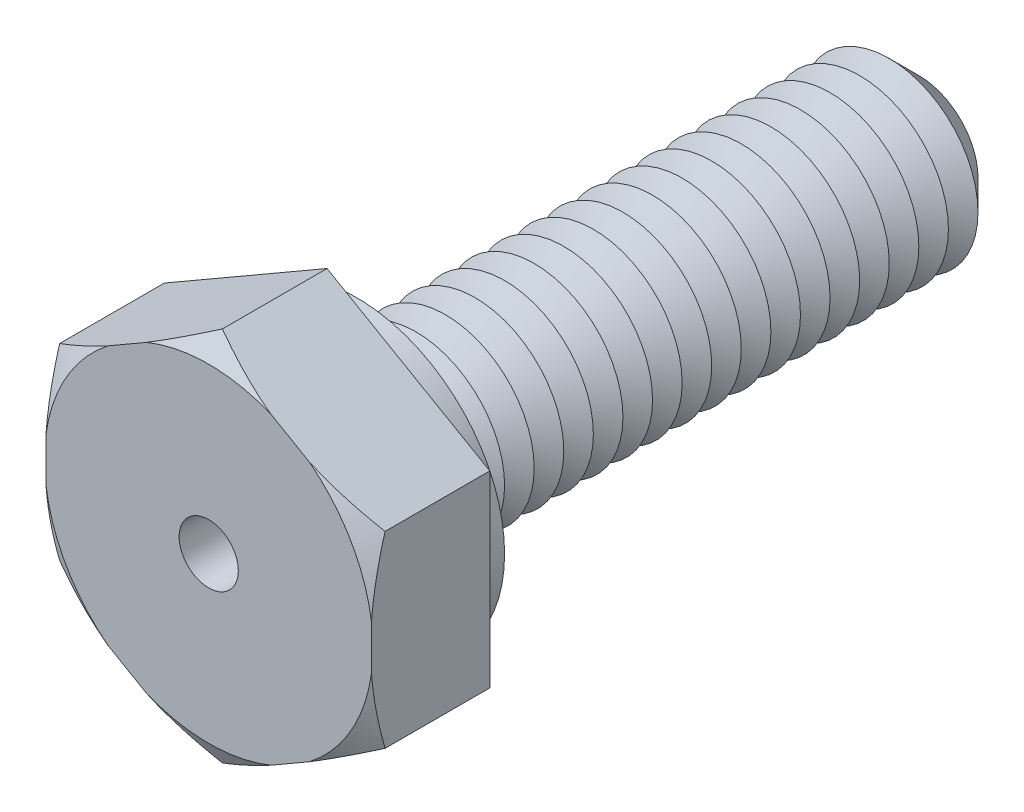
ISO-10303-21;
HEADER;
FILE_DESCRIPTION(('STEP AP214'),'2;1');
FILE_NAME('part.step','',(''),(''),'','','');
FILE_SCHEMA(('AUTOMOTIVE_DESIGN { 1 0 10303 214 1 1 1 1 }'));
ENDSEC;
DATA;
#1=APPLICATION_CONTEXT('core data for automotive mechanical design processes');
#2=APPLICATION_PROTOCOL_DEFINITION('international standard','automotive_design',2000,#1);
#3=PRODUCT_CONTEXT('',#1,'mechanical');
#4=PRODUCT('Part','Part','',(#3));
#5=PRODUCT_RELATED_PRODUCT_CATEGORY('part','',(#4));
#6=PRODUCT_DEFINITION_FORMATION('','',#4);
#7=PRODUCT_DEFINITION_CONTEXT('part definition',#1,'design');
#8=PRODUCT_DEFINITION('design','',#6,#7);
#9=PRODUCT_DEFINITION_SHAPE('','',#8);
#10=(LENGTH_UNIT() NAMED_UNIT(*) SI_UNIT(.MILLI.,.METRE.));
#11=(NAMED_UNIT(*) PLANE_ANGLE_UNIT() SI_UNIT($,.RADIAN.));
#12=(NAMED_UNIT(*) SI_UNIT($,.STERADIAN.) SOLID_ANGLE_UNIT());
#13=UNCERTAINTY_MEASURE_WITH_UNIT(LENGTH_MEASURE(1.E-05),#10,'distance_accuracy_value','');
#14=(GEOMETRIC_REPRESENTATION_CONTEXT(3) GLOBAL_UNCERTAINTY_ASSIGNED_CONTEXT((#13)) GLOBAL_UNIT_ASSIGNED_CONTEXT((#10,
#11,#12)) REPRESENTATION_CONTEXT('',''));
#15=CARTESIAN_POINT('',(0.,0.,0.));
#16=DIRECTION('',(0.,0.,1.));
#17=DIRECTION('',(1.,0.,0.));
#18=AXIS2_PLACEMENT_3D('',#15,#16,#17);
#19=CARTESIAN_POINT('',(2.75,1.58771324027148,2.));
#20=DIRECTION('',(-0.5,-0.866025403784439,0.));
#21=DIRECTION('',(0.866025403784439,-0.5,0.));
#22=AXIS2_PLACEMENT_3D('',#19,#20,#21);
#23=PLANE('',#22);
#24=CARTESIAN_POINT('',(4.66048793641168,0.484692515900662,0.897146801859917));
#25=CARTESIAN_POINT('',(4.57407924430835,0.53458059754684,0.94377821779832));
#26=CARTESIAN_POINT('',(4.48746398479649,0.584587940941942,0.989906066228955));
#27=CARTESIAN_POINT('',(4.31373297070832,0.684891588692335,1.08092005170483));
#28=CARTESIAN_POINT('',(4.22661715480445,0.735187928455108,1.12580603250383));
#29=CARTESIAN_POINT('',(4.05153903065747,0.836269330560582,1.21423144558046));
#30=CARTESIAN_POINT('',(3.96357490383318,0.887055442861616,1.25776609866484));
#31=CARTESIAN_POINT('',(3.78698874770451,0.989007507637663,1.34300583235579));
#32=CARTESIAN_POINT('',(3.69836673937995,1.04017344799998,1.38471097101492));
#33=CARTESIAN_POINT('',(3.42682968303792,1.196945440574,1.50858888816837));
#34=CARTESIAN_POINT('',(3.2426849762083,1.30326143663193,1.58723569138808));
#35=CARTESIAN_POINT('',(2.87039319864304,1.51820419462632,1.73037556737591));
#36=CARTESIAN_POINT('',(2.68225085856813,1.62682822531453,1.7948844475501));
#37=CARTESIAN_POINT('',(2.36072167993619,1.81246318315,1.88587189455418));
#38=CARTESIAN_POINT('',(2.22854222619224,1.88877702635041,1.91793719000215));
#39=CARTESIAN_POINT('',(1.9623222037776,2.04247922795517,1.96931401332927));
#40=CARTESIAN_POINT('',(1.82828230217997,2.11986720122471,1.98862999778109));
#41=CARTESIAN_POINT('',(1.56075616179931,2.27432349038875,2.0122791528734));
#42=CARTESIAN_POINT('',(1.42728171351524,2.35138499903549,2.01678452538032));
#43=CARTESIAN_POINT('',(1.16057863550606,2.50536609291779,2.01073620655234));
#44=CARTESIAN_POINT('',(1.02735002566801,2.58228566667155,2.00018134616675));
#45=CARTESIAN_POINT('',(0.804211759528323,2.71111460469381,1.97079823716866));
#46=CARTESIAN_POINT('',(0.713917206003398,2.76324618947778,1.95563842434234));
#47=CARTESIAN_POINT('',(0.534175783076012,2.86701994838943,1.91960186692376));
#48=CARTESIAN_POINT('',(0.444729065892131,2.91866203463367,1.89872411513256));
#49=CARTESIAN_POINT('',(0.266714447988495,3.02143882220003,1.85203328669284));
#50=CARTESIAN_POINT('',(0.17814764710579,3.07257288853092,1.82621469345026));
#51=CARTESIAN_POINT('',(0.0020075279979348,3.17426743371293,1.77045729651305));
#52=CARTESIAN_POINT('',(-0.08556585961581,3.22482795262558,1.74051878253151));
#53=CARTESIAN_POINT('',(-0.260818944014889,3.3260103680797,1.67685588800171));
#54=CARTESIAN_POINT('',(-0.348487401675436,3.37662577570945,1.64309053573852));
#55=CARTESIAN_POINT('',(-0.522893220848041,3.47731902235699,1.57271678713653));
#56=CARTESIAN_POINT('',(-0.609631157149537,3.52739719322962,1.53611027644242));
#57=CARTESIAN_POINT('',(-0.868655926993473,3.67694521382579,1.4228111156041));
#58=CARTESIAN_POINT('',(-1.03979736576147,3.775753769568,1.34262239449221));
#59=CARTESIAN_POINT('',(-1.26895816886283,3.90805982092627,1.23025748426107));
#60=CARTESIAN_POINT('',(-1.32802105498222,3.94215979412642,1.20084468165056));
#61=CARTESIAN_POINT('',(-1.44588766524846,4.01021011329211,1.14133764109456));
#62=CARTESIAN_POINT('',(-1.50469139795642,4.0441604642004,1.11124342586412));
#63=CARTESIAN_POINT('',(-1.67950896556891,4.14509143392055,1.02069737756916));
#64=CARTESIAN_POINT('',(-1.79518197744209,4.2118752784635,0.959363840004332));
#65=CARTESIAN_POINT('',(-1.91048793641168,4.27844720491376,0.897146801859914));
#66=B_SPLINE_CURVE_WITH_KNOTS('',3,(#24,#25,#26,#27,#28,#29,#30,#31,#32,#33,#34,#35,#36,#37,#38,
#39,#40,#41,#42,#43,#44,#45,#46,#47,#48,#49,#50,#51,#52,#53,#54,#55,#56,#57,#58,#59,#60,#61,#62,
#63,#64,#65),.UNSPECIFIED.,.F.,.F.,(4,2,2,2,2,2,2,2,2,2,2,2,2,2,2,2,2,2,2,2,4),(0.,
0.330408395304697,0.660858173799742,0.992367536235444,1.32386637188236,2.00369971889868,
2.68276903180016,3.15022294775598,3.61751337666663,4.0793510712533,4.54122461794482,
4.85714368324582,5.17311843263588,5.4894480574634,5.80575544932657,6.12584332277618,
6.44572054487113,7.08531613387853,7.30813289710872,7.5309422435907,7.97184194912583),.UNSPECIFIED.);
#67=CARTESIAN_POINT('',(2.75,1.58771324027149,1.76905989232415));
#68=VERTEX_POINT('',#67);
#69=CARTESIAN_POINT('',(1.69960608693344,2.1941584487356,2.));
#70=VERTEX_POINT('',#69);
#71=EDGE_CURVE('E132',#68,#70,#66,.T.);
#72=ORIENTED_EDGE('',*,*,#71,.F.);
#73=DIRECTION('',(0.,0.,-1.));
#74=VECTOR('',#73,1.);
#75=CARTESIAN_POINT('',(2.75,1.58771324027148,2.));
#76=LINE('',#75,#74);
#77=CARTESIAN_POINT('',(2.75,1.58771324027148,0.));
#78=VERTEX_POINT('',#77);
#79=EDGE_CURVE('E144',#68,#78,#76,.T.);
#80=ORIENTED_EDGE('',*,*,#79,.T.);
#81=DIRECTION('',(-0.866025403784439,0.5,0.));
#82=VECTOR('',#81,1.);
#83=CARTESIAN_POINT('',(2.75,1.58771324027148,0.));
#84=LINE('',#83,#82);
#85=CARTESIAN_POINT('',(0.,3.17542648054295,0.));
#86=VERTEX_POINT('',#85);
#87=EDGE_CURVE('E236',#78,#86,#84,.T.);
#88=ORIENTED_EDGE('',*,*,#87,.T.);
#89=DIRECTION('',(0.,0.,-1.));
#90=VECTOR('',#89,1.);
#91=CARTESIAN_POINT('',(0.,3.17542648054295,2.));
#92=LINE('',#91,#90);
#93=CARTESIAN_POINT('',(0.,3.17542648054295,1.76905989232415));
#94=VERTEX_POINT('',#93);
#95=EDGE_CURVE('E179',#94,#86,#92,.T.);
#96=ORIENTED_EDGE('',*,*,#95,.F.);
#97=CARTESIAN_POINT('',(1.05039391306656,2.56898127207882,2.));
#98=VERTEX_POINT('',#97);
#99=EDGE_CURVE('E151',#98,#94,#66,.T.);
#100=ORIENTED_EDGE('',*,*,#99,.F.);
#101=DIRECTION('',(-0.866025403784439,0.5,0.));
#102=VECTOR('',#101,1.);
#103=CARTESIAN_POINT('',(2.75,1.58771324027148,2.));
#104=LINE('',#103,#102);
#105=EDGE_CURVE('E148',#70,#98,#104,.T.);
#106=ORIENTED_EDGE('',*,*,#105,.F.);
#107=EDGE_LOOP('',(#72,#80,#88,#96,#100,#106));
#108=FACE_BOUND('',#107,.T.);
#109=ADVANCED_FACE('F39',(#108),#23,.F.);
#110=CARTESIAN_POINT('',(0.,3.17542648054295,2.));
#111=DIRECTION('',(0.5,-0.866025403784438,0.));
#112=DIRECTION('',(0.866025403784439,0.5,0.));
#113=AXIS2_PLACEMENT_3D('',#110,#111,#112);
#114=PLANE('',#113);
#115=CARTESIAN_POINT('',(1.91048793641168,4.27844720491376,0.897146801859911));
#116=CARTESIAN_POINT('',(1.82407924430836,4.22855912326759,0.943778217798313));
#117=CARTESIAN_POINT('',(1.7374639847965,4.17855177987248,0.989906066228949));
#118=CARTESIAN_POINT('',(1.56373297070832,4.07824813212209,1.08092005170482));
#119=CARTESIAN_POINT('',(1.47661715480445,4.02795179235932,1.12580603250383));
#120=CARTESIAN_POINT('',(1.30153903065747,3.92687039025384,1.21423144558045));
#121=CARTESIAN_POINT('',(1.21357490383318,3.87608427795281,1.25776609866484));
#122=CARTESIAN_POINT('',(1.03698874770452,3.77413221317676,1.34300583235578));
#123=CARTESIAN_POINT('',(0.948366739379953,3.72296627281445,1.38471097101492));
#124=CARTESIAN_POINT('',(0.676829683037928,3.56619428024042,1.50858888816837));
#125=CARTESIAN_POINT('',(0.492684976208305,3.4598782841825,1.58723569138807));
#126=CARTESIAN_POINT('',(0.120393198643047,3.24493552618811,1.73037556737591));
#127=CARTESIAN_POINT('',(-0.0677491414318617,3.1363114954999,1.7948844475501));
#128=CARTESIAN_POINT('',(-0.389278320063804,2.95067653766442,1.88587189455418));
#129=CARTESIAN_POINT('',(-0.521457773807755,2.87436269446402,1.91793719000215));
#130=CARTESIAN_POINT('',(-0.787677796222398,2.72066049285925,1.96931401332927));
#131=CARTESIAN_POINT('',(-0.921717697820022,2.64327251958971,1.98862999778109));
#132=CARTESIAN_POINT('',(-1.18924383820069,2.48881623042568,2.0122791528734));
#133=CARTESIAN_POINT('',(-1.32271828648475,2.41175472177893,2.01678452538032));
#134=CARTESIAN_POINT('',(-1.58942136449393,2.25777362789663,2.01073620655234));
#135=CARTESIAN_POINT('',(-1.72264997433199,2.18085405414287,2.00018134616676));
#136=CARTESIAN_POINT('',(-1.94578824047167,2.05202511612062,1.97079823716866));
#137=CARTESIAN_POINT('',(-2.03608279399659,1.99989353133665,1.95563842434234));
#138=CARTESIAN_POINT('',(-2.21582421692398,1.896119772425,1.91960186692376));
#139=CARTESIAN_POINT('',(-2.30527093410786,1.84447768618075,1.89872411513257));
#140=CARTESIAN_POINT('',(-2.48328555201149,1.7417008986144,1.85203328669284));
#141=CARTESIAN_POINT('',(-2.5718523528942,1.69056683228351,1.82621469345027));
#142=CARTESIAN_POINT('',(-2.74799247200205,1.5888722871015,1.77045729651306));
#143=CARTESIAN_POINT('',(-2.8355658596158,1.53831176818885,1.74051878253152));
#144=CARTESIAN_POINT('',(-3.01081894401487,1.43712935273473,1.67685588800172));
#145=CARTESIAN_POINT('',(-3.09848740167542,1.38651394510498,1.64309053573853));
#146=CARTESIAN_POINT('',(-3.27289322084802,1.28582069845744,1.57271678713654));
#147=CARTESIAN_POINT('',(-3.35963115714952,1.23574252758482,1.53611027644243));
#148=CARTESIAN_POINT('',(-3.61865592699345,1.08619450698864,1.42281111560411));
#149=CARTESIAN_POINT('',(-3.78979736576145,0.987385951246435,1.34262239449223));
#150=CARTESIAN_POINT('',(-4.01895816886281,0.855079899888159,1.23025748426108));
#151=CARTESIAN_POINT('',(-4.0780210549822,0.820979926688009,1.20084468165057));
#152=CARTESIAN_POINT('',(-4.19588766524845,0.752929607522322,1.14133764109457));
#153=CARTESIAN_POINT('',(-4.25469139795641,0.718979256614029,1.11124342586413));
#154=CARTESIAN_POINT('',(-4.42950896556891,0.618048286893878,1.02069737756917));
#155=CARTESIAN_POINT('',(-4.54518197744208,0.551264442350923,0.959363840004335));
#156=CARTESIAN_POINT('',(-4.66048793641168,0.484692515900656,0.897146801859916));
#157=B_SPLINE_CURVE_WITH_KNOTS('',3,(#115,#116,#117,#118,#119,#120,#121,#122,#123,#124,#125,
#126,#127,#128,#129,#130,#131,#132,#133,#134,#135,#136,#137,#138,#139,#140,#141,#142,#143,#144,
#145,#146,#147,#148,#149,#150,#151,#152,#153,#154,#155,#156),.UNSPECIFIED.,.F.,.F.,(4,2,2,2,2,2,
2,2,2,2,2,2,2,2,2,2,2,2,2,2,4),(0.,0.330408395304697,0.660858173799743,0.992367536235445,
1.32386637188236,2.00369971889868,2.68276903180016,3.15022294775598,3.61751337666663,
4.0793510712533,4.54122461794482,4.85714368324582,5.17311843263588,5.48944805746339,
5.80575544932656,6.12584332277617,6.44572054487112,7.08531613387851,7.30813289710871,
7.5309422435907,7.97184194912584),.UNSPECIFIED.);
#158=CARTESIAN_POINT('',(-1.05039391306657,2.56898127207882,2.));
#159=VERTEX_POINT('',#158);
#160=EDGE_CURVE('E416',#94,#159,#157,.T.);
#161=ORIENTED_EDGE('',*,*,#160,.F.);
#162=ORIENTED_EDGE('',*,*,#95,.T.);
#163=DIRECTION('',(-0.866025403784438,-0.5,0.));
#164=VECTOR('',#163,1.);
#165=CARTESIAN_POINT('',(0.,3.17542648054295,0.));
#166=LINE('',#165,#164);
#167=CARTESIAN_POINT('',(-2.75,1.58771324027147,0.));
#168=VERTEX_POINT('',#167);
#169=EDGE_CURVE('E239',#86,#168,#166,.T.);
#170=ORIENTED_EDGE('',*,*,#169,.T.);
#171=DIRECTION('',(0.,0.,-1.));
#172=VECTOR('',#171,1.);
#173=CARTESIAN_POINT('',(-2.75,1.58771324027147,2.));
#174=LINE('',#173,#172);
#175=CARTESIAN_POINT('',(-2.75,1.58771324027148,1.76905989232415));
#176=VERTEX_POINT('',#175);
#177=EDGE_CURVE('E176',#176,#168,#174,.T.);
#178=ORIENTED_EDGE('',*,*,#177,.F.);
#179=CARTESIAN_POINT('',(-1.69960608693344,2.1941584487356,2.));
#180=VERTEX_POINT('',#179);
#181=EDGE_CURVE('E408',#180,#176,#157,.T.);
#182=ORIENTED_EDGE('',*,*,#181,.F.);
#183=DIRECTION('',(-0.866025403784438,-0.5,0.));
#184=VECTOR('',#183,1.);
#185=CARTESIAN_POINT('',(0.,3.17542648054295,2.));
#186=LINE('',#185,#184);
#187=EDGE_CURVE('E213',#159,#180,#186,.T.);
#188=ORIENTED_EDGE('',*,*,#187,.F.);
#189=EDGE_LOOP('',(#161,#162,#170,#178,#182,#188));
#190=FACE_BOUND('',#189,.T.);
#191=ADVANCED_FACE('F422',(#190),#114,.F.);
#192=CARTESIAN_POINT('',(-2.75,1.58771324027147,2.));
#193=DIRECTION('',(1.,0.,0.));
#194=DIRECTION('',(0.,0.,-1.));
#195=AXIS2_PLACEMENT_3D('',#192,#193,#194);
#196=PLANE('',#195);
#197=CARTESIAN_POINT('',(-2.75,3.49820117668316,1.03335245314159));
#198=CARTESIAN_POINT('',(-2.75,3.3988452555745,1.07843728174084));
#199=CARTESIAN_POINT('',(-2.75,3.29921780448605,1.12293477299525));
#200=CARTESIAN_POINT('',(-2.75,3.09930320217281,1.21047025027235));
#201=CARTESIAN_POINT('',(-2.75,2.99901593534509,1.25350797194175));
#202=CARTESIAN_POINT('',(-2.75,2.79728071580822,1.33799855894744));
#203=CARTESIAN_POINT('',(-2.75,2.69582966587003,1.37944406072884));
#204=CARTESIAN_POINT('',(-2.75,2.49207131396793,1.46016516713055));
#205=CARTESIAN_POINT('',(-2.75,2.38976405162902,1.49944087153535));
#206=CARTESIAN_POINT('',(-2.75,2.18462050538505,1.57517230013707));
#207=CARTESIAN_POINT('',(-2.75,2.0817886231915,1.61163983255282));
#208=CARTESIAN_POINT('',(-2.75,1.87503931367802,1.68134876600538));
#209=CARTESIAN_POINT('',(-2.75,1.7711218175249,1.71458996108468));
#210=CARTESIAN_POINT('',(-2.75,1.45784948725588,1.80833694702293));
#211=CARTESIAN_POINT('',(-2.75,1.24663799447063,1.86299520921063));
#212=CARTESIAN_POINT('',(-2.75,0.880007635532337,1.93741428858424));
#213=CARTESIAN_POINT('',(-2.75,0.725721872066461,1.96267397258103));
#214=CARTESIAN_POINT('',(-2.75,0.415477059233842,1.99905142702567));
#215=CARTESIAN_POINT('',(-2.75,0.259518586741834,2.01017392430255));
#216=CARTESIAN_POINT('',(-2.75,-0.052664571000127,2.01694102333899));
#217=CARTESIAN_POINT('',(-2.75,-0.208889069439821,2.01259389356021));
#218=CARTESIAN_POINT('',(-2.75,-0.520179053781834,1.98898893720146));
#219=CARTESIAN_POINT('',(-2.75,-0.675244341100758,1.96972861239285));
#220=CARTESIAN_POINT('',(-2.75,-1.0603123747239,1.90556109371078));
#221=CARTESIAN_POINT('',(-2.75,-1.28896433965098,1.85264132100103));
#222=CARTESIAN_POINT('',(-2.75,-1.62776674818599,1.75827794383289));
#223=CARTESIAN_POINT('',(-2.75,-1.74015276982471,1.72427052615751));
#224=CARTESIAN_POINT('',(-2.75,-1.96362143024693,1.65220283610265));
#225=CARTESIAN_POINT('',(-2.75,-2.07470418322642,1.61414292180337));
#226=CARTESIAN_POINT('',(-2.75,-2.2969572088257,1.53431422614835));
#227=CARTESIAN_POINT('',(-2.75,-2.40811380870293,1.49250783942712));
#228=CARTESIAN_POINT('',(-2.75,-2.62938860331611,1.40621968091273));
#229=CARTESIAN_POINT('',(-2.75,-2.73950673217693,1.36173774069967));
#230=CARTESIAN_POINT('',(-2.75,-2.95816234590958,1.27090723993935));
#231=CARTESIAN_POINT('',(-2.75,-3.06670540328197,1.22457202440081));
#232=CARTESIAN_POINT('',(-2.75,-3.2830047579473,1.130169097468));
#233=CARTESIAN_POINT('',(-2.75,-3.39076124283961,1.08210181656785));
#234=CARTESIAN_POINT('',(-2.75,-3.49820117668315,1.03335245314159));
#235=B_SPLINE_CURVE_WITH_KNOTS('',3,(#197,#198,#199,#200,#201,#202,#203,#204,#205,#206,#207,
#208,#209,#210,#211,#212,#213,#214,#215,#216,#217,#218,#219,#220,#221,#222,#223,#224,#225,#226,
#227,#228,#229,#230,#231,#232,#233,#234),.UNSPECIFIED.,.F.,.F.,(4,2,2,2,2,2,2,2,2,2,2,2,2,2,2,2,
2,2,4),(0.,0.327324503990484,0.654707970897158,0.983457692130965,1.31219228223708,
1.63945907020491,1.96674673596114,2.62024190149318,3.08872929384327,3.55706000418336,
4.02514043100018,4.49329928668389,5.19584793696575,5.54806763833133,5.9002562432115,
6.25649337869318,6.61275296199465,6.96679459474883,7.32074883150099),.UNSPECIFIED.);
#236=CARTESIAN_POINT('',(-2.75,0.374822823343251,2.));
#237=VERTEX_POINT('',#236);
#238=EDGE_CURVE('E220',#176,#237,#235,.T.);
#239=ORIENTED_EDGE('',*,*,#238,.F.);
#240=ORIENTED_EDGE('',*,*,#177,.T.);
#241=DIRECTION('',(0.,-1.,0.));
#242=VECTOR('',#241,1.);
#243=CARTESIAN_POINT('',(-2.75,1.58771324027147,0.));
#244=LINE('',#243,#242);
#245=CARTESIAN_POINT('',(-2.75,-1.58771324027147,0.));
#246=VERTEX_POINT('',#245);
#247=EDGE_CURVE('E244',#168,#246,#244,.T.);
#248=ORIENTED_EDGE('',*,*,#247,.T.);
#249=DIRECTION('',(0.,0.,-1.));
#250=VECTOR('',#249,1.);
#251=CARTESIAN_POINT('',(-2.75,-1.58771324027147,2.));
#252=LINE('',#251,#250);
#253=CARTESIAN_POINT('',(-2.75000000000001,-1.58771324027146,1.76905989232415));
#254=VERTEX_POINT('',#253);
#255=EDGE_CURVE('E173',#254,#246,#252,.T.);
#256=ORIENTED_EDGE('',*,*,#255,.F.);
#257=CARTESIAN_POINT('',(-2.75,-0.374822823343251,2.));
#258=VERTEX_POINT('',#257);
#259=EDGE_CURVE('E223',#258,#254,#235,.T.);
#260=ORIENTED_EDGE('',*,*,#259,.F.);
#261=DIRECTION('',(0.,-1.,0.));
#262=VECTOR('',#261,1.);
#263=CARTESIAN_POINT('',(-2.75,1.58771324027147,2.));
#264=LINE('',#263,#262);
#265=EDGE_CURVE('E211',#237,#258,#264,.T.);
#266=ORIENTED_EDGE('',*,*,#265,.F.);
#267=EDGE_LOOP('',(#239,#240,#248,#256,#260,#266));
#268=FACE_BOUND('',#267,.T.);
#269=ADVANCED_FACE('F219',(#268),#196,.F.);
#270=CARTESIAN_POINT('',(-2.75,-1.58771324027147,2.));
#271=DIRECTION('',(0.5,0.866025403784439,0.));
#272=DIRECTION('',(-0.866025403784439,0.5,0.));
#273=AXIS2_PLACEMENT_3D('',#270,#271,#272);
#274=PLANE('',#273);
#275=CARTESIAN_POINT('',(-4.66048793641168,-0.48469251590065,0.897146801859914));
#276=CARTESIAN_POINT('',(-4.57407924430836,-0.534580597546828,0.943778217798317));
#277=CARTESIAN_POINT('',(-4.4874639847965,-0.58458794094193,0.989906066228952));
#278=CARTESIAN_POINT('',(-4.31373297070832,-0.684891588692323,1.08092005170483));
#279=CARTESIAN_POINT('',(-4.22661715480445,-0.735187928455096,1.12580603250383));
#280=CARTESIAN_POINT('',(-4.05153903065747,-0.836269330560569,1.21423144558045));
#281=CARTESIAN_POINT('',(-3.96357490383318,-0.887055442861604,1.25776609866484));
#282=CARTESIAN_POINT('',(-3.78698874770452,-0.989007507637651,1.34300583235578));
#283=CARTESIAN_POINT('',(-3.69836673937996,-1.04017344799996,1.38471097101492));
#284=CARTESIAN_POINT('',(-3.42682968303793,-1.19694544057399,1.50858888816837));
#285=CARTESIAN_POINT('',(-3.24268497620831,-1.30326143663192,1.58723569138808));
#286=CARTESIAN_POINT('',(-2.87039319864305,-1.5182041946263,1.73037556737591));
#287=CARTESIAN_POINT('',(-2.68225085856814,-1.62682822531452,1.7948844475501));
#288=CARTESIAN_POINT('',(-2.3607216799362,-1.81246318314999,1.88587189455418));
#289=CARTESIAN_POINT('',(-2.22854222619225,-1.8887770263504,1.91793719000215));
#290=CARTESIAN_POINT('',(-1.96232220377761,-2.04247922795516,1.96931401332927));
#291=CARTESIAN_POINT('',(-1.82828230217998,-2.1198672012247,1.9886299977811));
#292=CARTESIAN_POINT('',(-1.56075616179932,-2.27432349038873,2.0122791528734));
#293=CARTESIAN_POINT('',(-1.42728171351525,-2.35138499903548,2.01678452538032));
#294=CARTESIAN_POINT('',(-1.16057863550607,-2.50536609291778,2.01073620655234));
#295=CARTESIAN_POINT('',(-1.02735002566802,-2.58228566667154,2.00018134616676));
#296=CARTESIAN_POINT('',(-0.804211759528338,-2.71111460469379,1.97079823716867));
#297=CARTESIAN_POINT('',(-0.713917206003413,-2.76324618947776,1.95563842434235));
#298=CARTESIAN_POINT('',(-0.534175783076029,-2.86701994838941,1.91960186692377));
#299=CARTESIAN_POINT('',(-0.444729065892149,-2.91866203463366,1.89872411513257));
#300=CARTESIAN_POINT('',(-0.266714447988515,-3.02143882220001,1.85203328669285));
#301=CARTESIAN_POINT('',(-0.178147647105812,-3.0725728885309,1.82621469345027));
#302=CARTESIAN_POINT('',(-0.00200752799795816,-3.17426743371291,1.77045729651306));
#303=CARTESIAN_POINT('',(0.0855658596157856,-3.22482795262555,1.74051878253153));
#304=CARTESIAN_POINT('',(0.260818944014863,-3.32601036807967,1.67685588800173));
#305=CARTESIAN_POINT('',(0.348487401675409,-3.37662577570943,1.64309053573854));
#306=CARTESIAN_POINT('',(0.522893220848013,-3.47731902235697,1.57271678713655));
#307=CARTESIAN_POINT('',(0.609631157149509,-3.52739719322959,1.53611027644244));
#308=CARTESIAN_POINT('',(0.868655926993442,-3.67694521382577,1.42281111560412));
#309=CARTESIAN_POINT('',(1.03979736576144,-3.77575376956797,1.34262239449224));
#310=CARTESIAN_POINT('',(1.26895816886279,-3.90805982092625,1.23025748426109));
#311=CARTESIAN_POINT('',(1.32802105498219,-3.9421597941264,1.20084468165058));
#312=CARTESIAN_POINT('',(1.44588766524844,-4.01021011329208,1.14133764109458));
#313=CARTESIAN_POINT('',(1.5046913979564,-4.04416046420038,1.11124342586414));
#314=CARTESIAN_POINT('',(1.6795089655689,-4.14509143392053,1.02069737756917));
#315=CARTESIAN_POINT('',(1.79518197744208,-4.21187527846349,0.959363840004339));
#316=CARTESIAN_POINT('',(1.91048793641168,-4.27844720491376,0.897146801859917));
#317=B_SPLINE_CURVE_WITH_KNOTS('',3,(#275,#276,#277,#278,#279,#280,#281,#282,#283,#284,#285,
#286,#287,#288,#289,#290,#291,#292,#293,#294,#295,#296,#297,#298,#299,#300,#301,#302,#303,#304,
#305,#306,#307,#308,#309,#310,#311,#312,#313,#314,#315,#316),.UNSPECIFIED.,.F.,.F.,(4,2,2,2,2,2,
2,2,2,2,2,2,2,2,2,2,2,2,2,2,4),(0.,0.330408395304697,0.660858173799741,0.992367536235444,
1.32386637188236,2.00369971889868,2.68276903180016,3.15022294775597,3.61751337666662,
4.0793510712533,4.54122461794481,4.85714368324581,5.17311843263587,5.48944805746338,
5.80575544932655,6.12584332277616,6.44572054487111,7.08531613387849,7.3081328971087,
7.53094224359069,7.97184194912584),.UNSPECIFIED.);
#318=CARTESIAN_POINT('',(-1.69960608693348,-2.19415844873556,2.));
#319=VERTEX_POINT('',#318);
#320=EDGE_CURVE('E459',#254,#319,#317,.T.);
#321=ORIENTED_EDGE('',*,*,#320,.F.);
#322=ORIENTED_EDGE('',*,*,#255,.T.);
#323=DIRECTION('',(0.866025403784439,-0.5,0.));
#324=VECTOR('',#323,1.);
#325=CARTESIAN_POINT('',(-2.75,-1.58771324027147,0.));
#326=LINE('',#325,#324);
#327=CARTESIAN_POINT('',(0.,-3.17542648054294,0.));
#328=VERTEX_POINT('',#327);
#329=EDGE_CURVE('E247',#246,#328,#326,.T.);
#330=ORIENTED_EDGE('',*,*,#329,.T.);
#331=DIRECTION('',(0.,0.,-1.));
#332=VECTOR('',#331,1.);
#333=CARTESIAN_POINT('',(0.,-3.17542648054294,2.));
#334=LINE('',#333,#332);
#335=CARTESIAN_POINT('',(0.,-3.17542648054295,1.76905989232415));
#336=VERTEX_POINT('',#335);
#337=EDGE_CURVE('E163',#336,#328,#334,.T.);
#338=ORIENTED_EDGE('',*,*,#337,.F.);
#339=CARTESIAN_POINT('',(-1.05039391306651,-2.56898127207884,2.));
#340=VERTEX_POINT('',#339);
#341=EDGE_CURVE('E453',#340,#336,#317,.T.);
#342=ORIENTED_EDGE('',*,*,#341,.F.);
#343=DIRECTION('',(0.866025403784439,-0.5,0.));
#344=VECTOR('',#343,1.);
#345=CARTESIAN_POINT('',(-2.75,-1.58771324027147,2.));
#346=LINE('',#345,#344);
#347=EDGE_CURVE('E225',#319,#340,#346,.T.);
#348=ORIENTED_EDGE('',*,*,#347,.F.);
#349=EDGE_LOOP('',(#321,#322,#330,#338,#342,#348));
#350=FACE_BOUND('',#349,.T.);
#351=ADVANCED_FACE('F460',(#350),#274,.F.);
#352=CARTESIAN_POINT('',(0.,-3.17542648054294,2.));
#353=DIRECTION('',(-0.5,0.866025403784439,0.));
#354=DIRECTION('',(-0.866025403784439,-0.5,0.));
#355=AXIS2_PLACEMENT_3D('',#352,#353,#354);
#356=PLANE('',#355);
#357=CARTESIAN_POINT('',(-1.91048793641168,-4.27844720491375,0.897146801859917));
#358=CARTESIAN_POINT('',(-1.82407924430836,-4.22855912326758,0.94377821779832));
#359=CARTESIAN_POINT('',(-1.73746398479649,-4.17855177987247,0.989906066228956));
#360=CARTESIAN_POINT('',(-1.56373297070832,-4.07824813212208,1.08092005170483));
#361=CARTESIAN_POINT('',(-1.47661715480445,-4.02795179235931,1.12580603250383));
#362=CARTESIAN_POINT('',(-1.30153903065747,-3.92687039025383,1.21423144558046));
#363=CARTESIAN_POINT('',(-1.21357490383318,-3.8760842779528,1.25776609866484));
#364=CARTESIAN_POINT('',(-1.03698874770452,-3.77413221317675,1.34300583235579));
#365=CARTESIAN_POINT('',(-0.948366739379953,-3.72296627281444,1.38471097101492));
#366=CARTESIAN_POINT('',(-0.676829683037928,-3.56619428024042,1.50858888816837));
#367=CARTESIAN_POINT('',(-0.492684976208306,-3.45987828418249,1.58723569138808));
#368=CARTESIAN_POINT('',(-0.120393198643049,-3.2449355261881,1.73037556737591));
#369=CARTESIAN_POINT('',(0.0677491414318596,-3.13631149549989,1.7948844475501));
#370=CARTESIAN_POINT('',(0.389278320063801,-2.95067653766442,1.88587189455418));
#371=CARTESIAN_POINT('',(0.521457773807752,-2.87436269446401,1.91793719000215));
#372=CARTESIAN_POINT('',(0.787677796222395,-2.72066049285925,1.96931401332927));
#373=CARTESIAN_POINT('',(0.921717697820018,-2.64327251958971,1.9886299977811));
#374=CARTESIAN_POINT('',(1.18924383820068,-2.48881623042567,2.0122791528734));
#375=CARTESIAN_POINT('',(1.32271828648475,-2.41175472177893,2.01678452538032));
#376=CARTESIAN_POINT('',(1.58942136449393,-2.25777362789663,2.01073620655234));
#377=CARTESIAN_POINT('',(1.72264997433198,-2.18085405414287,2.00018134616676));
#378=CARTESIAN_POINT('',(1.94578824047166,-2.05202511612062,1.97079823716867));
#379=CARTESIAN_POINT('',(2.03608279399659,-1.99989353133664,1.95563842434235));
#380=CARTESIAN_POINT('',(2.21582421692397,-1.89611977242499,1.91960186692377));
#381=CARTESIAN_POINT('',(2.30527093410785,-1.84447768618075,1.89872411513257));
#382=CARTESIAN_POINT('',(2.48328555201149,-1.7417008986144,1.85203328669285));
#383=CARTESIAN_POINT('',(2.57185235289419,-1.69056683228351,1.82621469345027));
#384=CARTESIAN_POINT('',(2.74799247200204,-1.58887228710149,1.77045729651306));
#385=CARTESIAN_POINT('',(2.83556585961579,-1.53831176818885,1.74051878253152));
#386=CARTESIAN_POINT('',(3.01081894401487,-1.43712935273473,1.67685588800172));
#387=CARTESIAN_POINT('',(3.09848740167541,-1.38651394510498,1.64309053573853));
#388=CARTESIAN_POINT('',(3.27289322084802,-1.28582069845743,1.57271678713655));
#389=CARTESIAN_POINT('',(3.35963115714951,-1.23574252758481,1.53611027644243));
#390=CARTESIAN_POINT('',(3.61865592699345,-1.08619450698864,1.42281111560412));
#391=CARTESIAN_POINT('',(3.78979736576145,-0.987385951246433,1.34262239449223));
#392=CARTESIAN_POINT('',(4.0189581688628,-0.855079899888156,1.23025748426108));
#393=CARTESIAN_POINT('',(4.0780210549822,-0.820979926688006,1.20084468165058));
#394=CARTESIAN_POINT('',(4.19588766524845,-0.752929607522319,1.14133764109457));
#395=CARTESIAN_POINT('',(4.2546913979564,-0.718979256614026,1.11124342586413));
#396=CARTESIAN_POINT('',(4.4295089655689,-0.618048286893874,1.02069737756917));
#397=CARTESIAN_POINT('',(4.54518197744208,-0.551264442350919,0.959363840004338));
#398=CARTESIAN_POINT('',(4.66048793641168,-0.484692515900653,0.897146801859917));
#399=B_SPLINE_CURVE_WITH_KNOTS('',3,(#357,#358,#359,#360,#361,#362,#363,#364,#365,#366,#367,
#368,#369,#370,#371,#372,#373,#374,#375,#376,#377,#378,#379,#380,#381,#382,#383,#384,#385,#386,
#387,#388,#389,#390,#391,#392,#393,#394,#395,#396,#397,#398),.UNSPECIFIED.,.F.,.F.,(4,2,2,2,2,2,
2,2,2,2,2,2,2,2,2,2,2,2,2,2,4),(0.,0.330408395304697,0.660858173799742,0.992367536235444,
1.32386637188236,2.00369971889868,2.68276903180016,3.15022294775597,3.61751337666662,
4.0793510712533,4.54122461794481,4.85714368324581,5.17311843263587,5.48944805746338,
5.80575544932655,6.12584332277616,6.44572054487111,7.0853161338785,7.3081328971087,
7.53094224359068,7.97184194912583),.UNSPECIFIED.);
#400=CARTESIAN_POINT('',(1.05039391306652,-2.56898127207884,2.));
#401=VERTEX_POINT('',#400);
#402=EDGE_CURVE('E64',#336,#401,#399,.T.);
#403=ORIENTED_EDGE('',*,*,#402,.F.);
#404=ORIENTED_EDGE('',*,*,#337,.T.);
#405=DIRECTION('',(0.866025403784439,0.5,0.));
#406=VECTOR('',#405,1.);
#407=CARTESIAN_POINT('',(0.,-3.17542648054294,0.));
#408=LINE('',#407,#406);
#409=CARTESIAN_POINT('',(2.75,-1.58771324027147,0.));
#410=VERTEX_POINT('',#409);
#411=EDGE_CURVE('E250',#328,#410,#408,.T.);
#412=ORIENTED_EDGE('',*,*,#411,.T.);
#413=DIRECTION('',(0.,0.,-1.));
#414=VECTOR('',#413,1.);
#415=CARTESIAN_POINT('',(2.75,-1.58771324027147,2.));
#416=LINE('',#415,#414);
#417=CARTESIAN_POINT('',(2.75,-1.58771324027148,1.76905989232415));
#418=VERTEX_POINT('',#417);
#419=EDGE_CURVE('E157',#418,#410,#416,.T.);
#420=ORIENTED_EDGE('',*,*,#419,.F.);
#421=CARTESIAN_POINT('',(1.69960608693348,-2.19415844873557,2.));
#422=VERTEX_POINT('',#421);
#423=EDGE_CURVE('E448',#422,#418,#399,.T.);
#424=ORIENTED_EDGE('',*,*,#423,.F.);
#425=DIRECTION('',(0.866025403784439,0.5,0.));
#426=VECTOR('',#425,1.);
#427=CARTESIAN_POINT('',(0.,-3.17542648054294,2.));
#428=LINE('',#427,#426);
#429=EDGE_CURVE('E166',#401,#422,#428,.T.);
#430=ORIENTED_EDGE('',*,*,#429,.F.);
#431=EDGE_LOOP('',(#403,#404,#412,#420,#424,#430));
#432=FACE_BOUND('',#431,.T.);
#433=ADVANCED_FACE('F463',(#432),#356,.F.);
#434=CARTESIAN_POINT('',(2.75,-1.58771324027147,2.));
#435=DIRECTION('',(-1.,0.,0.));
#436=DIRECTION('',(0.,-1.,0.));
#437=AXIS2_PLACEMENT_3D('',#434,#435,#436);
#438=PLANE('',#437);
#439=CARTESIAN_POINT('',(2.75,-3.49820117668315,1.03335245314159));
#440=CARTESIAN_POINT('',(2.75,-3.3988452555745,1.07843728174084));
#441=CARTESIAN_POINT('',(2.75,-3.29921780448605,1.12293477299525));
#442=CARTESIAN_POINT('',(2.75,-3.0993032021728,1.21047025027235));
#443=CARTESIAN_POINT('',(2.75,-2.99901593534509,1.25350797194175));
#444=CARTESIAN_POINT('',(2.75,-2.79728071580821,1.33799855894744));
#445=CARTESIAN_POINT('',(2.75,-2.69582966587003,1.37944406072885));
#446=CARTESIAN_POINT('',(2.75,-2.49207131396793,1.46016516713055));
#447=CARTESIAN_POINT('',(2.75,-2.38976405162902,1.49944087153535));
#448=CARTESIAN_POINT('',(2.75,-2.18462050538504,1.57517230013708));
#449=CARTESIAN_POINT('',(2.75,-2.08178862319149,1.61163983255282));
#450=CARTESIAN_POINT('',(2.75,-1.87503931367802,1.68134876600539));
#451=CARTESIAN_POINT('',(2.75,-1.77112181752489,1.71458996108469));
#452=CARTESIAN_POINT('',(2.75,-1.45784948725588,1.80833694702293));
#453=CARTESIAN_POINT('',(2.75,-1.24663799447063,1.86299520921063));
#454=CARTESIAN_POINT('',(2.75,-0.880007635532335,1.93741428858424));
#455=CARTESIAN_POINT('',(2.75,-0.72572187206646,1.96267397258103));
#456=CARTESIAN_POINT('',(2.75,-0.41547705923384,1.99905142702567));
#457=CARTESIAN_POINT('',(2.75,-0.259518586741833,2.01017392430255));
#458=CARTESIAN_POINT('',(2.75,0.052664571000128,2.01694102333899));
#459=CARTESIAN_POINT('',(2.75,0.208889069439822,2.01259389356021));
#460=CARTESIAN_POINT('',(2.75,0.520179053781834,1.98898893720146));
#461=CARTESIAN_POINT('',(2.75,0.675244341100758,1.96972861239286));
#462=CARTESIAN_POINT('',(2.75,1.0603123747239,1.90556109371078));
#463=CARTESIAN_POINT('',(2.75,1.28896433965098,1.85264132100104));
#464=CARTESIAN_POINT('',(2.75,1.627766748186,1.75827794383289));
#465=CARTESIAN_POINT('',(2.75,1.74015276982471,1.72427052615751));
#466=CARTESIAN_POINT('',(2.75,1.96362143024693,1.65220283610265));
#467=CARTESIAN_POINT('',(2.75,2.07470418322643,1.61414292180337));
#468=CARTESIAN_POINT('',(2.75,2.2969572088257,1.53431422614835));
#469=CARTESIAN_POINT('',(2.75,2.40811380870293,1.49250783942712));
#470=CARTESIAN_POINT('',(2.75,2.62938860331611,1.40621968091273));
#471=CARTESIAN_POINT('',(2.75,2.73950673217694,1.36173774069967));
#472=CARTESIAN_POINT('',(2.75,2.95816234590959,1.27090723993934));
#473=CARTESIAN_POINT('',(2.75,3.06670540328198,1.22457202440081));
#474=CARTESIAN_POINT('',(2.75,3.28300475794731,1.130169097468));
#475=CARTESIAN_POINT('',(2.75,3.39076124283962,1.08210181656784));
#476=CARTESIAN_POINT('',(2.75,3.49820117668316,1.03335245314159));
#477=B_SPLINE_CURVE_WITH_KNOTS('',3,(#439,#440,#441,#442,#443,#444,#445,#446,#447,#448,#449,
#450,#451,#452,#453,#454,#455,#456,#457,#458,#459,#460,#461,#462,#463,#464,#465,#466,#467,#468,
#469,#470,#471,#472,#473,#474,#475,#476),.UNSPECIFIED.,.F.,.F.,(4,2,2,2,2,2,2,2,2,2,2,2,2,2,2,2,
2,2,4),(0.,0.327324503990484,0.654707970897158,0.983457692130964,1.31219228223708,
1.63945907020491,1.96674673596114,2.62024190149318,3.08872929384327,3.55706000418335,
4.02514043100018,4.49329928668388,5.19584793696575,5.54806763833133,5.9002562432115,
6.25649337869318,6.61275296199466,6.96679459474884,7.320748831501),.UNSPECIFIED.);
#478=CARTESIAN_POINT('',(2.75,-0.374822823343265,2.));
#479=VERTEX_POINT('',#478);
#480=EDGE_CURVE('E56',#418,#479,#477,.T.);
#481=ORIENTED_EDGE('',*,*,#480,.F.);
#482=ORIENTED_EDGE('',*,*,#419,.T.);
#483=DIRECTION('',(0.,1.,0.));
#484=VECTOR('',#483,1.);
#485=CARTESIAN_POINT('',(2.75,-1.58771324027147,0.));
#486=LINE('',#485,#484);
#487=EDGE_CURVE('E154',#410,#78,#486,.T.);
#488=ORIENTED_EDGE('',*,*,#487,.T.);
#489=ORIENTED_EDGE('',*,*,#79,.F.);
#490=CARTESIAN_POINT('',(2.75,0.374822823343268,2.));
#491=VERTEX_POINT('',#490);
#492=EDGE_CURVE('E129',#491,#68,#477,.T.);
#493=ORIENTED_EDGE('',*,*,#492,.F.);
#494=DIRECTION('',(0.,1.,0.));
#495=VECTOR('',#494,1.);
#496=CARTESIAN_POINT('',(2.75,-1.58771324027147,2.));
#497=LINE('',#496,#495);
#498=EDGE_CURVE('E158',#479,#491,#497,.T.);
#499=ORIENTED_EDGE('',*,*,#498,.F.);
#500=EDGE_LOOP('',(#481,#482,#488,#489,#493,#499));
#501=FACE_BOUND('',#500,.T.);
#502=ADVANCED_FACE('F152',(#501),#438,.F.);
#503=CARTESIAN_POINT('',(0.,0.,2.));
#504=DIRECTION('',(0.,0.,1.));
#505=DIRECTION('',(1.,0.,0.));
#506=AXIS2_PLACEMENT_3D('',#503,#504,#505);
#507=PLANE('',#506);
#508=CARTESIAN_POINT('',(0.,0.,2.));
#509=DIRECTION('',(0.,0.,1.));
#510=DIRECTION('',(1.,0.,0.));
#511=AXIS2_PLACEMENT_3D('',#508,#509,#510);
#512=CIRCLE('',#511,0.5);
#513=CARTESIAN_POINT('',(0.5,0.,2.));
#514=VERTEX_POINT('',#513);
#515=EDGE_CURVE('E1035',#514,#514,#512,.T.);
#516=ORIENTED_EDGE('',*,*,#515,.F.);
#517=EDGE_LOOP('',(#516));
#518=FACE_BOUND('',#517,.T.);
#519=ORIENTED_EDGE('',*,*,#498,.T.);
#520=CARTESIAN_POINT('',(0.,0.,2.));
#521=DIRECTION('',(0.,0.,1.));
#522=DIRECTION('',(1.,0.,0.));
#523=AXIS2_PLACEMENT_3D('',#520,#521,#522);
#524=CIRCLE('',#523,2.77542648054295);
#525=EDGE_CURVE('E134',#491,#70,#524,.T.);
#526=ORIENTED_EDGE('',*,*,#525,.T.);
#527=ORIENTED_EDGE('',*,*,#105,.T.);
#528=CARTESIAN_POINT('',(0.,0.,2.));
#529=DIRECTION('',(0.,0.,1.));
#530=DIRECTION('',(1.,0.,0.));
#531=AXIS2_PLACEMENT_3D('',#528,#529,#530);
#532=CIRCLE('',#531,2.77542648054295);
#533=EDGE_CURVE('E11',#98,#159,#532,.T.);
#534=ORIENTED_EDGE('',*,*,#533,.T.);
#535=ORIENTED_EDGE('',*,*,#187,.T.);
#536=EDGE_CURVE('E49',#180,#237,#532,.T.);
#537=ORIENTED_EDGE('',*,*,#536,.T.);
#538=ORIENTED_EDGE('',*,*,#265,.T.);
#539=EDGE_CURVE('E196',#258,#319,#532,.T.);
#540=ORIENTED_EDGE('',*,*,#539,.T.);
#541=ORIENTED_EDGE('',*,*,#347,.T.);
#542=EDGE_CURVE('E191',#340,#401,#532,.T.);
#543=ORIENTED_EDGE('',*,*,#542,.T.);
#544=ORIENTED_EDGE('',*,*,#429,.T.);
#545=EDGE_CURVE('E43',#422,#479,#532,.T.);
#546=ORIENTED_EDGE('',*,*,#545,.T.);
#547=EDGE_LOOP('',(#519,#526,#527,#534,#535,#537,#538,#540,#541,#543,#544,#546));
#548=FACE_BOUND('',#547,.T.);
#549=ADVANCED_FACE('F210',(#518,#548),#507,.T.);
#550=CARTESIAN_POINT('',(0.,0.,0.));
#551=DIRECTION('',(0.,0.,1.));
#552=DIRECTION('',(1.,0.,0.));
#553=AXIS2_PLACEMENT_3D('',#550,#551,#552);
#554=PLANE('',#553);
#555=CARTESIAN_POINT('',(0.,0.,0.));
#556=DIRECTION('',(0.,0.,1.));
#557=DIRECTION('',(1.,0.,0.));
#558=AXIS2_PLACEMENT_3D('',#555,#556,#557);
#559=CIRCLE('',#558,2.5);
#560=CARTESIAN_POINT('',(2.5,0.,0.));
#561=VERTEX_POINT('',#560);
#562=EDGE_CURVE('E182',#561,#561,#559,.F.);
#563=ORIENTED_EDGE('',*,*,#562,.F.);
#564=EDGE_LOOP('',(#563));
#565=FACE_BOUND('',#564,.T.);
#566=ORIENTED_EDGE('',*,*,#87,.F.);
#567=ORIENTED_EDGE('',*,*,#487,.F.);
#568=ORIENTED_EDGE('',*,*,#411,.F.);
#569=ORIENTED_EDGE('',*,*,#329,.F.);
#570=ORIENTED_EDGE('',*,*,#247,.F.);
#571=ORIENTED_EDGE('',*,*,#169,.F.);
#572=EDGE_LOOP('',(#566,#567,#568,#569,#570,#571));
#573=FACE_BOUND('',#572,.T.);
#574=ADVANCED_FACE('F507',(#565,#573),#554,.F.);
#575=CARTESIAN_POINT('',(0.,0.,-0.5));
#576=DIRECTION('',(0.,0.,1.));
#577=DIRECTION('',(1.,0.,0.));
#578=AXIS2_PLACEMENT_3D('',#575,#576,#577);
#579=CYLINDRICAL_SURFACE('',#578,2.5);
#580=CARTESIAN_POINT('',(0.,0.,-0.5));
#581=DIRECTION('',(0.,0.,-1.));
#582=DIRECTION('',(-1.,0.,0.));
#583=AXIS2_PLACEMENT_3D('',#580,#581,#582);
#584=CIRCLE('',#583,2.5);
#585=CARTESIAN_POINT('',(-2.5,0.,-0.5));
#586=VERTEX_POINT('',#585);
#587=EDGE_CURVE('E240',#586,#586,#584,.T.);
#588=ORIENTED_EDGE('',*,*,#587,.F.);
#589=EDGE_LOOP('',(#588));
#590=FACE_BOUND('',#589,.T.);
#591=ORIENTED_EDGE('',*,*,#562,.T.);
#592=EDGE_LOOP('',(#591));
#593=FACE_BOUND('',#592,.T.);
#594=ADVANCED_FACE('F518',(#590,#593),#579,.T.);
#595=CARTESIAN_POINT('',(0.,0.,-0.5));
#596=DIRECTION('',(0.,0.,-1.));
#597=DIRECTION('',(-1.,0.,0.));
#598=AXIS2_PLACEMENT_3D('',#595,#596,#597);
#599=PLANE('',#598);
#600=CARTESIAN_POINT('',(0.,0.,-0.5));
#601=DIRECTION('',(0.,0.,1.));
#602=DIRECTION('',(1.,0.,0.));
#603=AXIS2_PLACEMENT_3D('',#600,#601,#602);
#604=CIRCLE('',#603,1.5);
#605=CARTESIAN_POINT('',(1.5,0.,-0.5));
#606=VERTEX_POINT('',#605);
#607=EDGE_CURVE('E265',#606,#606,#604,.T.);
#608=ORIENTED_EDGE('',*,*,#607,.T.);
#609=EDGE_LOOP('',(#608));
#610=FACE_BOUND('',#609,.T.);
#611=ORIENTED_EDGE('',*,*,#587,.T.);
#612=EDGE_LOOP('',(#611));
#613=FACE_BOUND('',#612,.T.);
#614=ADVANCED_FACE('F527',(#610,#613),#599,.T.);
#615=CARTESIAN_POINT('',(0.,0.,-0.5));
#616=DIRECTION('',(0.,0.,1.));
#617=DIRECTION('',(1.,0.,0.));
#618=AXIS2_PLACEMENT_3D('',#615,#616,#617);
#619=CONICAL_SURFACE('',#618,1.5,1.0471975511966);
#620=CARTESIAN_POINT('',(0.,0.,-0.75));
#621=DIRECTION('',(0.,0.,1.));
#622=DIRECTION('',(1.,0.,0.));
#623=AXIS2_PLACEMENT_3D('',#620,#621,#622);
#624=CIRCLE('',#623,1.06698729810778);
#625=CARTESIAN_POINT('',(1.06698729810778,0.,-0.75));
#626=VERTEX_POINT('',#625);
#627=EDGE_CURVE('E268',#626,#626,#624,.T.);
#628=ORIENTED_EDGE('',*,*,#627,.T.);
#629=EDGE_LOOP('',(#628));
#630=FACE_BOUND('',#629,.T.);
#631=ORIENTED_EDGE('',*,*,#607,.F.);
#632=EDGE_LOOP('',(#631));
#633=FACE_BOUND('',#632,.T.);
#634=ADVANCED_FACE('F536',(#630,#633),#619,.T.);
#635=CARTESIAN_POINT('',(0.,0.,-0.75));
#636=DIRECTION('',(0.,0.,-1.));
#637=DIRECTION('',(-1.,0.,0.));
#638=AXIS2_PLACEMENT_3D('',#635,#636,#637);
#639=CONICAL_SURFACE('',#638,1.06698729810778,1.0471975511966);
#640=CARTESIAN_POINT('',(0.,0.,-1.));
#641=DIRECTION('',(0.,0.,1.));
#642=DIRECTION('',(1.,0.,0.));
#643=AXIS2_PLACEMENT_3D('',#640,#641,#642);
#644=CIRCLE('',#643,1.5);
#645=CARTESIAN_POINT('',(1.5,0.,-1.));
#646=VERTEX_POINT('',#645);
#647=EDGE_CURVE('E272',#646,#646,#644,.T.);
#648=ORIENTED_EDGE('',*,*,#647,.T.);
#649=EDGE_LOOP('',(#648));
#650=FACE_BOUND('',#649,.T.);
#651=ORIENTED_EDGE('',*,*,#627,.F.);
#652=EDGE_LOOP('',(#651));
#653=FACE_BOUND('',#652,.T.);
#654=ADVANCED_FACE('F546',(#650,#653),#639,.T.);
#655=CARTESIAN_POINT('',(0.,0.,-1.));
#656=DIRECTION('',(0.,0.,1.));
#657=DIRECTION('',(1.,0.,0.));
#658=AXIS2_PLACEMENT_3D('',#655,#656,#657);
#659=CONICAL_SURFACE('',#658,1.5,1.0471975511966);
#660=CARTESIAN_POINT('',(0.,0.,-1.25));
#661=DIRECTION('',(0.,0.,1.));
#662=DIRECTION('',(1.,0.,0.));
#663=AXIS2_PLACEMENT_3D('',#660,#661,#662);
#664=CIRCLE('',#663,1.06698729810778);
#665=CARTESIAN_POINT('',(1.06698729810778,0.,-1.25));
#666=VERTEX_POINT('',#665);
#667=EDGE_CURVE('E275',#666,#666,#664,.T.);
#668=ORIENTED_EDGE('',*,*,#667,.T.);
#669=EDGE_LOOP('',(#668));
#670=FACE_BOUND('',#669,.T.);
#671=ORIENTED_EDGE('',*,*,#647,.F.);
#672=EDGE_LOOP('',(#671));
#673=FACE_BOUND('',#672,.T.);
#674=ADVANCED_FACE('F555',(#670,#673),#659,.T.);
#675=CARTESIAN_POINT('',(0.,0.,-1.25));
#676=DIRECTION('',(0.,0.,-1.));
#677=DIRECTION('',(-1.,0.,0.));
#678=AXIS2_PLACEMENT_3D('',#675,#676,#677);
#679=CONICAL_SURFACE('',#678,1.06698729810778,1.0471975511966);
#680=CARTESIAN_POINT('',(0.,0.,-1.5));
#681=DIRECTION('',(0.,0.,1.));
#682=DIRECTION('',(1.,0.,0.));
#683=AXIS2_PLACEMENT_3D('',#680,#681,#682);
#684=CIRCLE('',#683,1.5);
#685=CARTESIAN_POINT('',(1.5,0.,-1.5));
#686=VERTEX_POINT('',#685);
#687=EDGE_CURVE('E279',#686,#686,#684,.T.);
#688=ORIENTED_EDGE('',*,*,#687,.T.);
#689=EDGE_LOOP('',(#688));
#690=FACE_BOUND('',#689,.T.);
#691=ORIENTED_EDGE('',*,*,#667,.F.);
#692=EDGE_LOOP('',(#691));
#693=FACE_BOUND('',#692,.T.);
#694=ADVANCED_FACE('F564',(#690,#693),#679,.T.);
#695=CARTESIAN_POINT('',(0.,0.,-1.5));
#696=DIRECTION('',(0.,0.,1.));
#697=DIRECTION('',(1.,0.,0.));
#698=AXIS2_PLACEMENT_3D('',#695,#696,#697);
#699=CONICAL_SURFACE('',#698,1.5,1.0471975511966);
#700=CARTESIAN_POINT('',(0.,0.,-1.75));
#701=DIRECTION('',(0.,0.,1.));
#702=DIRECTION('',(1.,0.,0.));
#703=AXIS2_PLACEMENT_3D('',#700,#701,#702);
#704=CIRCLE('',#703,1.06698729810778);
#705=CARTESIAN_POINT('',(1.06698729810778,0.,-1.75));
#706=VERTEX_POINT('',#705);
#707=EDGE_CURVE('E283',#706,#706,#704,.T.);
#708=ORIENTED_EDGE('',*,*,#707,.T.);
#709=EDGE_LOOP('',(#708));
#710=FACE_BOUND('',#709,.T.);
#711=ORIENTED_EDGE('',*,*,#687,.F.);
#712=EDGE_LOOP('',(#711));
#713=FACE_BOUND('',#712,.T.);
#714=ADVANCED_FACE('F573',(#710,#713),#699,.T.);
#715=CARTESIAN_POINT('',(0.,0.,-1.75));
#716=DIRECTION('',(0.,0.,-1.));
#717=DIRECTION('',(-1.,0.,0.));
#718=AXIS2_PLACEMENT_3D('',#715,#716,#717);
#719=CONICAL_SURFACE('',#718,1.06698729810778,1.0471975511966);
#720=CARTESIAN_POINT('',(0.,0.,-2.));
#721=DIRECTION('',(0.,0.,1.));
#722=DIRECTION('',(1.,0.,0.));
#723=AXIS2_PLACEMENT_3D('',#720,#721,#722);
#724=CIRCLE('',#723,1.5);
#725=CARTESIAN_POINT('',(1.5,0.,-2.));
#726=VERTEX_POINT('',#725);
#727=EDGE_CURVE('E287',#726,#726,#724,.T.);
#728=ORIENTED_EDGE('',*,*,#727,.T.);
#729=EDGE_LOOP('',(#728));
#730=FACE_BOUND('',#729,.T.);
#731=ORIENTED_EDGE('',*,*,#707,.F.);
#732=EDGE_LOOP('',(#731));
#733=FACE_BOUND('',#732,.T.);
#734=ADVANCED_FACE('F582',(#730,#733),#719,.T.);
#735=CARTESIAN_POINT('',(0.,0.,-2.));
#736=DIRECTION('',(0.,0.,1.));
#737=DIRECTION('',(1.,0.,0.));
#738=AXIS2_PLACEMENT_3D('',#735,#736,#737);
#739=CONICAL_SURFACE('',#738,1.5,1.0471975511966);
#740=CARTESIAN_POINT('',(0.,0.,-2.25));
#741=DIRECTION('',(0.,0.,1.));
#742=DIRECTION('',(1.,0.,0.));
#743=AXIS2_PLACEMENT_3D('',#740,#741,#742);
#744=CIRCLE('',#743,1.06698729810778);
#745=CARTESIAN_POINT('',(1.06698729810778,0.,-2.25));
#746=VERTEX_POINT('',#745);
#747=EDGE_CURVE('E290',#746,#746,#744,.T.);
#748=ORIENTED_EDGE('',*,*,#747,.T.);
#749=EDGE_LOOP('',(#748));
#750=FACE_BOUND('',#749,.T.);
#751=ORIENTED_EDGE('',*,*,#727,.F.);
#752=EDGE_LOOP('',(#751));
#753=FACE_BOUND('',#752,.T.);
#754=ADVANCED_FACE('F591',(#750,#753),#739,.T.);
#755=CARTESIAN_POINT('',(0.,0.,-2.25));
#756=DIRECTION('',(0.,0.,-1.));
#757=DIRECTION('',(-1.,0.,0.));
#758=AXIS2_PLACEMENT_3D('',#755,#756,#757);
#759=CONICAL_SURFACE('',#758,1.06698729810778,1.0471975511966);
#760=CARTESIAN_POINT('',(0.,0.,-2.5));
#761=DIRECTION('',(0.,0.,1.));
#762=DIRECTION('',(1.,0.,0.));
#763=AXIS2_PLACEMENT_3D('',#760,#761,#762);
#764=CIRCLE('',#763,1.5);
#765=CARTESIAN_POINT('',(1.5,0.,-2.5));
#766=VERTEX_POINT('',#765);
#767=EDGE_CURVE('E294',#766,#766,#764,.T.);
#768=ORIENTED_EDGE('',*,*,#767,.T.);
#769=EDGE_LOOP('',(#768));
#770=FACE_BOUND('',#769,.T.);
#771=ORIENTED_EDGE('',*,*,#747,.F.);
#772=EDGE_LOOP('',(#771));
#773=FACE_BOUND('',#772,.T.);
#774=ADVANCED_FACE('F600',(#770,#773),#759,.T.);
#775=CARTESIAN_POINT('',(0.,0.,-2.5));
#776=DIRECTION('',(0.,0.,1.));
#777=DIRECTION('',(1.,0.,0.));
#778=AXIS2_PLACEMENT_3D('',#775,#776,#777);
#779=CONICAL_SURFACE('',#778,1.5,1.0471975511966);
#780=CARTESIAN_POINT('',(0.,0.,-2.75));
#781=DIRECTION('',(0.,0.,1.));
#782=DIRECTION('',(1.,0.,0.));
#783=AXIS2_PLACEMENT_3D('',#780,#781,#782);
#784=CIRCLE('',#783,1.06698729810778);
#785=CARTESIAN_POINT('',(1.06698729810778,0.,-2.75));
#786=VERTEX_POINT('',#785);
#787=EDGE_CURVE('E298',#786,#786,#784,.T.);
#788=ORIENTED_EDGE('',*,*,#787,.T.);
#789=EDGE_LOOP('',(#788));
#790=FACE_BOUND('',#789,.T.);
#791=ORIENTED_EDGE('',*,*,#767,.F.);
#792=EDGE_LOOP('',(#791));
#793=FACE_BOUND('',#792,.T.);
#794=ADVANCED_FACE('F609',(#790,#793),#779,.T.);
#795=CARTESIAN_POINT('',(0.,0.,-2.75));
#796=DIRECTION('',(0.,0.,-1.));
#797=DIRECTION('',(-1.,0.,0.));
#798=AXIS2_PLACEMENT_3D('',#795,#796,#797);
#799=CONICAL_SURFACE('',#798,1.06698729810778,1.0471975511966);
#800=CARTESIAN_POINT('',(0.,0.,-3.));
#801=DIRECTION('',(0.,0.,1.));
#802=DIRECTION('',(1.,0.,0.));
#803=AXIS2_PLACEMENT_3D('',#800,#801,#802);
#804=CIRCLE('',#803,1.5);
#805=CARTESIAN_POINT('',(1.5,0.,-3.));
#806=VERTEX_POINT('',#805);
#807=EDGE_CURVE('E301',#806,#806,#804,.T.);
#808=ORIENTED_EDGE('',*,*,#807,.T.);
#809=EDGE_LOOP('',(#808));
#810=FACE_BOUND('',#809,.T.);
#811=ORIENTED_EDGE('',*,*,#787,.F.);
#812=EDGE_LOOP('',(#811));
#813=FACE_BOUND('',#812,.T.);
#814=ADVANCED_FACE('F618',(#810,#813),#799,.T.);
#815=CARTESIAN_POINT('',(0.,0.,-3.));
#816=DIRECTION('',(0.,0.,1.));
#817=DIRECTION('',(1.,0.,0.));
#818=AXIS2_PLACEMENT_3D('',#815,#816,#817);
#819=CONICAL_SURFACE('',#818,1.5,1.0471975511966);
#820=CARTESIAN_POINT('',(0.,0.,-3.25));
#821=DIRECTION('',(0.,0.,1.));
#822=DIRECTION('',(1.,0.,0.));
#823=AXIS2_PLACEMENT_3D('',#820,#821,#822);
#824=CIRCLE('',#823,1.06698729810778);
#825=CARTESIAN_POINT('',(1.06698729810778,0.,-3.25));
#826=VERTEX_POINT('',#825);
#827=EDGE_CURVE('E305',#826,#826,#824,.T.);
#828=ORIENTED_EDGE('',*,*,#827,.T.);
#829=EDGE_LOOP('',(#828));
#830=FACE_BOUND('',#829,.T.);
#831=ORIENTED_EDGE('',*,*,#807,.F.);
#832=EDGE_LOOP('',(#831));
#833=FACE_BOUND('',#832,.T.);
#834=ADVANCED_FACE('F627',(#830,#833),#819,.T.);
#835=CARTESIAN_POINT('',(0.,0.,-3.25));
#836=DIRECTION('',(0.,0.,-1.));
#837=DIRECTION('',(-1.,0.,0.));
#838=AXIS2_PLACEMENT_3D('',#835,#836,#837);
#839=CONICAL_SURFACE('',#838,1.06698729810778,1.0471975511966);
#840=CARTESIAN_POINT('',(0.,0.,-3.5));
#841=DIRECTION('',(0.,0.,1.));
#842=DIRECTION('',(1.,0.,0.));
#843=AXIS2_PLACEMENT_3D('',#840,#841,#842);
#844=CIRCLE('',#843,1.5);
#845=CARTESIAN_POINT('',(1.5,0.,-3.5));
#846=VERTEX_POINT('',#845);
#847=EDGE_CURVE('E309',#846,#846,#844,.T.);
#848=ORIENTED_EDGE('',*,*,#847,.T.);
#849=EDGE_LOOP('',(#848));
#850=FACE_BOUND('',#849,.T.);
#851=ORIENTED_EDGE('',*,*,#827,.F.);
#852=EDGE_LOOP('',(#851));
#853=FACE_BOUND('',#852,.T.);
#854=ADVANCED_FACE('F636',(#850,#853),#839,.T.);
#855=CARTESIAN_POINT('',(0.,0.,-3.5));
#856=DIRECTION('',(0.,0.,1.));
#857=DIRECTION('',(1.,0.,0.));
#858=AXIS2_PLACEMENT_3D('',#855,#856,#857);
#859=CONICAL_SURFACE('',#858,1.5,1.0471975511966);
#860=CARTESIAN_POINT('',(0.,0.,-3.75));
#861=DIRECTION('',(0.,0.,1.));
#862=DIRECTION('',(1.,0.,0.));
#863=AXIS2_PLACEMENT_3D('',#860,#861,#862);
#864=CIRCLE('',#863,1.06698729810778);
#865=CARTESIAN_POINT('',(1.06698729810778,0.,-3.75));
#866=VERTEX_POINT('',#865);
#867=EDGE_CURVE('E313',#866,#866,#864,.T.);
#868=ORIENTED_EDGE('',*,*,#867,.T.);
#869=EDGE_LOOP('',(#868));
#870=FACE_BOUND('',#869,.T.);
#871=ORIENTED_EDGE('',*,*,#847,.F.);
#872=EDGE_LOOP('',(#871));
#873=FACE_BOUND('',#872,.T.);
#874=ADVANCED_FACE('F645',(#870,#873),#859,.T.);
#875=CARTESIAN_POINT('',(0.,0.,-3.75));
#876=DIRECTION('',(0.,0.,-1.));
#877=DIRECTION('',(-1.,0.,0.));
#878=AXIS2_PLACEMENT_3D('',#875,#876,#877);
#879=CONICAL_SURFACE('',#878,1.06698729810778,1.0471975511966);
#880=CARTESIAN_POINT('',(0.,0.,-4.));
#881=DIRECTION('',(0.,0.,1.));
#882=DIRECTION('',(1.,0.,0.));
#883=AXIS2_PLACEMENT_3D('',#880,#881,#882);
#884=CIRCLE('',#883,1.5);
#885=CARTESIAN_POINT('',(1.5,0.,-4.));
#886=VERTEX_POINT('',#885);
#887=EDGE_CURVE('E317',#886,#886,#884,.T.);
#888=ORIENTED_EDGE('',*,*,#887,.T.);
#889=EDGE_LOOP('',(#888));
#890=FACE_BOUND('',#889,.T.);
#891=ORIENTED_EDGE('',*,*,#867,.F.);
#892=EDGE_LOOP('',(#891));
#893=FACE_BOUND('',#892,.T.);
#894=ADVANCED_FACE('F654',(#890,#893),#879,.T.);
#895=CARTESIAN_POINT('',(0.,0.,-4.));
#896=DIRECTION('',(0.,0.,1.));
#897=DIRECTION('',(1.,0.,0.));
#898=AXIS2_PLACEMENT_3D('',#895,#896,#897);
#899=CONICAL_SURFACE('',#898,1.5,1.0471975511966);
#900=CARTESIAN_POINT('',(0.,0.,-4.25));
#901=DIRECTION('',(0.,0.,1.));
#902=DIRECTION('',(1.,0.,0.));
#903=AXIS2_PLACEMENT_3D('',#900,#901,#902);
#904=CIRCLE('',#903,1.06698729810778);
#905=CARTESIAN_POINT('',(1.06698729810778,0.,-4.25));
#906=VERTEX_POINT('',#905);
#907=EDGE_CURVE('E321',#906,#906,#904,.T.);
#908=ORIENTED_EDGE('',*,*,#907,.T.);
#909=EDGE_LOOP('',(#908));
#910=FACE_BOUND('',#909,.T.);
#911=ORIENTED_EDGE('',*,*,#887,.F.);
#912=EDGE_LOOP('',(#911));
#913=FACE_BOUND('',#912,.T.);
#914=ADVANCED_FACE('F663',(#910,#913),#899,.T.);
#915=CARTESIAN_POINT('',(0.,0.,-4.25));
#916=DIRECTION('',(0.,0.,-1.));
#917=DIRECTION('',(-1.,0.,0.));
#918=AXIS2_PLACEMENT_3D('',#915,#916,#917);
#919=CONICAL_SURFACE('',#918,1.06698729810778,1.0471975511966);
#920=CARTESIAN_POINT('',(0.,0.,-4.5));
#921=DIRECTION('',(0.,0.,1.));
#922=DIRECTION('',(1.,0.,0.));
#923=AXIS2_PLACEMENT_3D('',#920,#921,#922);
#924=CIRCLE('',#923,1.5);
#925=CARTESIAN_POINT('',(1.5,0.,-4.5));
#926=VERTEX_POINT('',#925);
#927=EDGE_CURVE('E325',#926,#926,#924,.T.);
#928=ORIENTED_EDGE('',*,*,#927,.T.);
#929=EDGE_LOOP('',(#928));
#930=FACE_BOUND('',#929,.T.);
#931=ORIENTED_EDGE('',*,*,#907,.F.);
#932=EDGE_LOOP('',(#931));
#933=FACE_BOUND('',#932,.T.);
#934=ADVANCED_FACE('F672',(#930,#933),#919,.T.);
#935=CARTESIAN_POINT('',(0.,0.,-4.5));
#936=DIRECTION('',(0.,0.,1.));
#937=DIRECTION('',(1.,0.,0.));
#938=AXIS2_PLACEMENT_3D('',#935,#936,#937);
#939=CONICAL_SURFACE('',#938,1.5,1.0471975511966);
#940=CARTESIAN_POINT('',(0.,0.,-4.75));
#941=DIRECTION('',(0.,0.,1.));
#942=DIRECTION('',(1.,0.,0.));
#943=AXIS2_PLACEMENT_3D('',#940,#941,#942);
#944=CIRCLE('',#943,1.06698729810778);
#945=CARTESIAN_POINT('',(1.06698729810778,0.,-4.75));
#946=VERTEX_POINT('',#945);
#947=EDGE_CURVE('E329',#946,#946,#944,.T.);
#948=ORIENTED_EDGE('',*,*,#947,.T.);
#949=EDGE_LOOP('',(#948));
#950=FACE_BOUND('',#949,.T.);
#951=ORIENTED_EDGE('',*,*,#927,.F.);
#952=EDGE_LOOP('',(#951));
#953=FACE_BOUND('',#952,.T.);
#954=ADVANCED_FACE('F681',(#950,#953),#939,.T.);
#955=CARTESIAN_POINT('',(0.,0.,-4.75));
#956=DIRECTION('',(0.,0.,-1.));
#957=DIRECTION('',(-1.,0.,0.));
#958=AXIS2_PLACEMENT_3D('',#955,#956,#957);
#959=CONICAL_SURFACE('',#958,1.06698729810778,1.0471975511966);
#960=CARTESIAN_POINT('',(0.,0.,-5.));
#961=DIRECTION('',(0.,0.,1.));
#962=DIRECTION('',(1.,0.,0.));
#963=AXIS2_PLACEMENT_3D('',#960,#961,#962);
#964=CIRCLE('',#963,1.5);
#965=CARTESIAN_POINT('',(1.5,0.,-5.));
#966=VERTEX_POINT('',#965);
#967=EDGE_CURVE('E333',#966,#966,#964,.T.);
#968=ORIENTED_EDGE('',*,*,#967,.T.);
#969=EDGE_LOOP('',(#968));
#970=FACE_BOUND('',#969,.T.);
#971=ORIENTED_EDGE('',*,*,#947,.F.);
#972=EDGE_LOOP('',(#971));
#973=FACE_BOUND('',#972,.T.);
#974=ADVANCED_FACE('F690',(#970,#973),#959,.T.);
#975=CARTESIAN_POINT('',(0.,0.,-5.));
#976=DIRECTION('',(0.,0.,1.));
#977=DIRECTION('',(1.,0.,0.));
#978=AXIS2_PLACEMENT_3D('',#975,#976,#977);
#979=CONICAL_SURFACE('',#978,1.5,1.0471975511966);
#980=CARTESIAN_POINT('',(0.,0.,-5.25));
#981=DIRECTION('',(0.,0.,1.));
#982=DIRECTION('',(1.,0.,0.));
#983=AXIS2_PLACEMENT_3D('',#980,#981,#982);
#984=CIRCLE('',#983,1.06698729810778);
#985=CARTESIAN_POINT('',(1.06698729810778,0.,-5.25));
#986=VERTEX_POINT('',#985);
#987=EDGE_CURVE('E337',#986,#986,#984,.T.);
#988=ORIENTED_EDGE('',*,*,#987,.T.);
#989=EDGE_LOOP('',(#988));
#990=FACE_BOUND('',#989,.T.);
#991=ORIENTED_EDGE('',*,*,#967,.F.);
#992=EDGE_LOOP('',(#991));
#993=FACE_BOUND('',#992,.T.);
#994=ADVANCED_FACE('F699',(#990,#993),#979,.T.);
#995=CARTESIAN_POINT('',(0.,0.,-5.25));
#996=DIRECTION('',(0.,0.,-1.));
#997=DIRECTION('',(-1.,0.,0.));
#998=AXIS2_PLACEMENT_3D('',#995,#996,#997);
#999=CONICAL_SURFACE('',#998,1.06698729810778,1.0471975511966);
#1000=CARTESIAN_POINT('',(0.,0.,-5.5));
#1001=DIRECTION('',(0.,0.,1.));
#1002=DIRECTION('',(1.,0.,0.));
#1003=AXIS2_PLACEMENT_3D('',#1000,#1001,#1002);
#1004=CIRCLE('',#1003,1.5);
#1005=CARTESIAN_POINT('',(1.5,0.,-5.5));
#1006=VERTEX_POINT('',#1005);
#1007=EDGE_CURVE('E341',#1006,#1006,#1004,.T.);
#1008=ORIENTED_EDGE('',*,*,#1007,.T.);
#1009=EDGE_LOOP('',(#1008));
#1010=FACE_BOUND('',#1009,.T.);
#1011=ORIENTED_EDGE('',*,*,#987,.F.);
#1012=EDGE_LOOP('',(#1011));
#1013=FACE_BOUND('',#1012,.T.);
#1014=ADVANCED_FACE('F708',(#1010,#1013),#999,.T.);
#1015=CARTESIAN_POINT('',(0.,0.,-5.5));
#1016=DIRECTION('',(0.,0.,1.));
#1017=DIRECTION('',(1.,0.,0.));
#1018=AXIS2_PLACEMENT_3D('',#1015,#1016,#1017);
#1019=CONICAL_SURFACE('',#1018,1.5,1.0471975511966);
#1020=CARTESIAN_POINT('',(0.,0.,-5.75));
#1021=DIRECTION('',(0.,0.,1.));
#1022=DIRECTION('',(1.,0.,0.));
#1023=AXIS2_PLACEMENT_3D('',#1020,#1021,#1022);
#1024=CIRCLE('',#1023,1.06698729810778);
#1025=CARTESIAN_POINT('',(1.06698729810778,0.,-5.75));
#1026=VERTEX_POINT('',#1025);
#1027=EDGE_CURVE('E345',#1026,#1026,#1024,.T.);
#1028=ORIENTED_EDGE('',*,*,#1027,.T.);
#1029=EDGE_LOOP('',(#1028));
#1030=FACE_BOUND('',#1029,.T.);
#1031=ORIENTED_EDGE('',*,*,#1007,.F.);
#1032=EDGE_LOOP('',(#1031));
#1033=FACE_BOUND('',#1032,.T.);
#1034=ADVANCED_FACE('F717',(#1030,#1033),#1019,.T.);
#1035=CARTESIAN_POINT('',(0.,0.,-5.75));
#1036=DIRECTION('',(0.,0.,-1.));
#1037=DIRECTION('',(-1.,0.,0.));
#1038=AXIS2_PLACEMENT_3D('',#1035,#1036,#1037);
#1039=CONICAL_SURFACE('',#1038,1.06698729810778,1.0471975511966);
#1040=CARTESIAN_POINT('',(0.,0.,-6.));
#1041=DIRECTION('',(0.,0.,1.));
#1042=DIRECTION('',(1.,0.,0.));
#1043=AXIS2_PLACEMENT_3D('',#1040,#1041,#1042);
#1044=CIRCLE('',#1043,1.5);
#1045=CARTESIAN_POINT('',(1.5,0.,-6.));
#1046=VERTEX_POINT('',#1045);
#1047=EDGE_CURVE('E349',#1046,#1046,#1044,.T.);
#1048=ORIENTED_EDGE('',*,*,#1047,.T.);
#1049=EDGE_LOOP('',(#1048));
#1050=FACE_BOUND('',#1049,.T.);
#1051=ORIENTED_EDGE('',*,*,#1027,.F.);
#1052=EDGE_LOOP('',(#1051));
#1053=FACE_BOUND('',#1052,.T.);
#1054=ADVANCED_FACE('F726',(#1050,#1053),#1039,.T.);
#1055=CARTESIAN_POINT('',(0.,0.,-6.));
#1056=DIRECTION('',(0.,0.,1.));
#1057=DIRECTION('',(1.,0.,0.));
#1058=AXIS2_PLACEMENT_3D('',#1055,#1056,#1057);
#1059=CONICAL_SURFACE('',#1058,1.5,1.0471975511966);
#1060=CARTESIAN_POINT('',(0.,0.,-6.25));
#1061=DIRECTION('',(0.,0.,1.));
#1062=DIRECTION('',(1.,0.,0.));
#1063=AXIS2_PLACEMENT_3D('',#1060,#1061,#1062);
#1064=CIRCLE('',#1063,1.06698729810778);
#1065=CARTESIAN_POINT('',(1.06698729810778,0.,-6.25));
#1066=VERTEX_POINT('',#1065);
#1067=EDGE_CURVE('E353',#1066,#1066,#1064,.T.);
#1068=ORIENTED_EDGE('',*,*,#1067,.T.);
#1069=EDGE_LOOP('',(#1068));
#1070=FACE_BOUND('',#1069,.T.);
#1071=ORIENTED_EDGE('',*,*,#1047,.F.);
#1072=EDGE_LOOP('',(#1071));
#1073=FACE_BOUND('',#1072,.T.);
#1074=ADVANCED_FACE('F735',(#1070,#1073),#1059,.T.);
#1075=CARTESIAN_POINT('',(0.,0.,-6.25));
#1076=DIRECTION('',(0.,0.,-1.));
#1077=DIRECTION('',(-1.,0.,0.));
#1078=AXIS2_PLACEMENT_3D('',#1075,#1076,#1077);
#1079=CONICAL_SURFACE('',#1078,1.06698729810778,1.0471975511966);
#1080=CARTESIAN_POINT('',(0.,0.,-6.5));
#1081=DIRECTION('',(0.,0.,1.));
#1082=DIRECTION('',(1.,0.,0.));
#1083=AXIS2_PLACEMENT_3D('',#1080,#1081,#1082);
#1084=CIRCLE('',#1083,1.5);
#1085=CARTESIAN_POINT('',(1.5,0.,-6.5));
#1086=VERTEX_POINT('',#1085);
#1087=EDGE_CURVE('E357',#1086,#1086,#1084,.T.);
#1088=ORIENTED_EDGE('',*,*,#1087,.T.);
#1089=EDGE_LOOP('',(#1088));
#1090=FACE_BOUND('',#1089,.T.);
#1091=ORIENTED_EDGE('',*,*,#1067,.F.);
#1092=EDGE_LOOP('',(#1091));
#1093=FACE_BOUND('',#1092,.T.);
#1094=ADVANCED_FACE('F744',(#1090,#1093),#1079,.T.);
#1095=CARTESIAN_POINT('',(0.,0.,-6.5));
#1096=DIRECTION('',(0.,0.,1.));
#1097=DIRECTION('',(1.,0.,0.));
#1098=AXIS2_PLACEMENT_3D('',#1095,#1096,#1097);
#1099=CONICAL_SURFACE('',#1098,1.5,1.0471975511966);
#1100=CARTESIAN_POINT('',(0.,0.,-6.75));
#1101=DIRECTION('',(0.,0.,1.));
#1102=DIRECTION('',(1.,0.,0.));
#1103=AXIS2_PLACEMENT_3D('',#1100,#1101,#1102);
#1104=CIRCLE('',#1103,1.06698729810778);
#1105=CARTESIAN_POINT('',(1.06698729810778,0.,-6.75));
#1106=VERTEX_POINT('',#1105);
#1107=EDGE_CURVE('E360',#1106,#1106,#1104,.T.);
#1108=ORIENTED_EDGE('',*,*,#1107,.T.);
#1109=EDGE_LOOP('',(#1108));
#1110=FACE_BOUND('',#1109,.T.);
#1111=ORIENTED_EDGE('',*,*,#1087,.F.);
#1112=EDGE_LOOP('',(#1111));
#1113=FACE_BOUND('',#1112,.T.);
#1114=ADVANCED_FACE('F753',(#1110,#1113),#1099,.T.);
#1115=CARTESIAN_POINT('',(0.,0.,-6.75));
#1116=DIRECTION('',(0.,0.,-1.));
#1117=DIRECTION('',(-1.,0.,0.));
#1118=AXIS2_PLACEMENT_3D('',#1115,#1116,#1117);
#1119=CONICAL_SURFACE('',#1118,1.06698729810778,1.0471975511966);
#1120=CARTESIAN_POINT('',(0.,0.,-7.));
#1121=DIRECTION('',(0.,0.,1.));
#1122=DIRECTION('',(1.,0.,0.));
#1123=AXIS2_PLACEMENT_3D('',#1120,#1121,#1122);
#1124=CIRCLE('',#1123,1.5);
#1125=CARTESIAN_POINT('',(1.5,0.,-7.));
#1126=VERTEX_POINT('',#1125);
#1127=EDGE_CURVE('E364',#1126,#1126,#1124,.T.);
#1128=ORIENTED_EDGE('',*,*,#1127,.T.);
#1129=EDGE_LOOP('',(#1128));
#1130=FACE_BOUND('',#1129,.T.);
#1131=ORIENTED_EDGE('',*,*,#1107,.F.);
#1132=EDGE_LOOP('',(#1131));
#1133=FACE_BOUND('',#1132,.T.);
#1134=ADVANCED_FACE('F762',(#1130,#1133),#1119,.T.);
#1135=CARTESIAN_POINT('',(0.,0.,-7.));
#1136=DIRECTION('',(0.,0.,1.));
#1137=DIRECTION('',(1.,0.,0.));
#1138=AXIS2_PLACEMENT_3D('',#1135,#1136,#1137);
#1139=CONICAL_SURFACE('',#1138,1.5,1.0471975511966);
#1140=CARTESIAN_POINT('',(0.,0.,-7.25));
#1141=DIRECTION('',(0.,0.,1.));
#1142=DIRECTION('',(1.,0.,0.));
#1143=AXIS2_PLACEMENT_3D('',#1140,#1141,#1142);
#1144=CIRCLE('',#1143,1.06698729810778);
#1145=CARTESIAN_POINT('',(1.06698729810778,0.,-7.25));
#1146=VERTEX_POINT('',#1145);
#1147=EDGE_CURVE('E368',#1146,#1146,#1144,.T.);
#1148=ORIENTED_EDGE('',*,*,#1147,.T.);
#1149=EDGE_LOOP('',(#1148));
#1150=FACE_BOUND('',#1149,.T.);
#1151=ORIENTED_EDGE('',*,*,#1127,.F.);
#1152=EDGE_LOOP('',(#1151));
#1153=FACE_BOUND('',#1152,.T.);
#1154=ADVANCED_FACE('F771',(#1150,#1153),#1139,.T.);
#1155=CARTESIAN_POINT('',(0.,0.,-7.25));
#1156=DIRECTION('',(0.,0.,-1.));
#1157=DIRECTION('',(-1.,0.,0.));
#1158=AXIS2_PLACEMENT_3D('',#1155,#1156,#1157);
#1159=CONICAL_SURFACE('',#1158,1.06698729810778,1.0471975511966);
#1160=CARTESIAN_POINT('',(0.,0.,-7.5));
#1161=DIRECTION('',(0.,0.,1.));
#1162=DIRECTION('',(1.,0.,0.));
#1163=AXIS2_PLACEMENT_3D('',#1160,#1161,#1162);
#1164=CIRCLE('',#1163,1.5);
#1165=CARTESIAN_POINT('',(1.5,0.,-7.5));
#1166=VERTEX_POINT('',#1165);
#1167=EDGE_CURVE('E372',#1166,#1166,#1164,.T.);
#1168=ORIENTED_EDGE('',*,*,#1167,.T.);
#1169=EDGE_LOOP('',(#1168));
#1170=FACE_BOUND('',#1169,.T.);
#1171=ORIENTED_EDGE('',*,*,#1147,.F.);
#1172=EDGE_LOOP('',(#1171));
#1173=FACE_BOUND('',#1172,.T.);
#1174=ADVANCED_FACE('F780',(#1170,#1173),#1159,.T.);
#1175=CARTESIAN_POINT('',(0.,0.,-7.5));
#1176=DIRECTION('',(0.,0.,1.));
#1177=DIRECTION('',(1.,0.,0.));
#1178=AXIS2_PLACEMENT_3D('',#1175,#1176,#1177);
#1179=CONICAL_SURFACE('',#1178,1.5,1.0471975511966);
#1180=CARTESIAN_POINT('',(0.,0.,-7.75));
#1181=DIRECTION('',(0.,0.,1.));
#1182=DIRECTION('',(1.,0.,0.));
#1183=AXIS2_PLACEMENT_3D('',#1180,#1181,#1182);
#1184=CIRCLE('',#1183,1.06698729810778);
#1185=CARTESIAN_POINT('',(1.06698729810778,0.,-7.75));
#1186=VERTEX_POINT('',#1185);
#1187=EDGE_CURVE('E376',#1186,#1186,#1184,.T.);
#1188=ORIENTED_EDGE('',*,*,#1187,.T.);
#1189=EDGE_LOOP('',(#1188));
#1190=FACE_BOUND('',#1189,.T.);
#1191=ORIENTED_EDGE('',*,*,#1167,.F.);
#1192=EDGE_LOOP('',(#1191));
#1193=FACE_BOUND('',#1192,.T.);
#1194=ADVANCED_FACE('F789',(#1190,#1193),#1179,.T.);
#1195=CARTESIAN_POINT('',(0.,0.,-7.75));
#1196=DIRECTION('',(0.,0.,-1.));
#1197=DIRECTION('',(-1.,0.,0.));
#1198=AXIS2_PLACEMENT_3D('',#1195,#1196,#1197);
#1199=CONICAL_SURFACE('',#1198,1.06698729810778,1.0471975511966);
#1200=CARTESIAN_POINT('',(0.,0.,-8.));
#1201=DIRECTION('',(0.,0.,1.));
#1202=DIRECTION('',(1.,0.,0.));
#1203=AXIS2_PLACEMENT_3D('',#1200,#1201,#1202);
#1204=CIRCLE('',#1203,1.5);
#1205=CARTESIAN_POINT('',(1.5,0.,-8.));
#1206=VERTEX_POINT('',#1205);
#1207=EDGE_CURVE('E380',#1206,#1206,#1204,.T.);
#1208=ORIENTED_EDGE('',*,*,#1207,.T.);
#1209=EDGE_LOOP('',(#1208));
#1210=FACE_BOUND('',#1209,.T.);
#1211=ORIENTED_EDGE('',*,*,#1187,.F.);
#1212=EDGE_LOOP('',(#1211));
#1213=FACE_BOUND('',#1212,.T.);
#1214=ADVANCED_FACE('F798',(#1210,#1213),#1199,.T.);
#1215=CARTESIAN_POINT('',(0.,0.,-8.));
#1216=DIRECTION('',(0.,0.,1.));
#1217=DIRECTION('',(1.,0.,0.));
#1218=AXIS2_PLACEMENT_3D('',#1215,#1216,#1217);
#1219=CONICAL_SURFACE('',#1218,1.5,1.0471975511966);
#1220=CARTESIAN_POINT('',(0.,0.,-8.25));
#1221=DIRECTION('',(0.,0.,1.));
#1222=DIRECTION('',(1.,0.,0.));
#1223=AXIS2_PLACEMENT_3D('',#1220,#1221,#1222);
#1224=CIRCLE('',#1223,1.06698729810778);
#1225=CARTESIAN_POINT('',(1.06698729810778,0.,-8.25));
#1226=VERTEX_POINT('',#1225);
#1227=EDGE_CURVE('E384',#1226,#1226,#1224,.T.);
#1228=ORIENTED_EDGE('',*,*,#1227,.T.);
#1229=EDGE_LOOP('',(#1228));
#1230=FACE_BOUND('',#1229,.T.);
#1231=ORIENTED_EDGE('',*,*,#1207,.F.);
#1232=EDGE_LOOP('',(#1231));
#1233=FACE_BOUND('',#1232,.T.);
#1234=ADVANCED_FACE('F807',(#1230,#1233),#1219,.T.);
#1235=CARTESIAN_POINT('',(0.,0.,-8.25));
#1236=DIRECTION('',(0.,0.,-1.));
#1237=DIRECTION('',(-1.,0.,0.));
#1238=AXIS2_PLACEMENT_3D('',#1235,#1236,#1237);
#1239=CONICAL_SURFACE('',#1238,1.06698729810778,1.0471975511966);
#1240=CARTESIAN_POINT('',(0.,0.,-8.5));
#1241=DIRECTION('',(0.,0.,1.));
#1242=DIRECTION('',(1.,0.,0.));
#1243=AXIS2_PLACEMENT_3D('',#1240,#1241,#1242);
#1244=CIRCLE('',#1243,1.5);
#1245=CARTESIAN_POINT('',(1.5,0.,-8.5));
#1246=VERTEX_POINT('',#1245);
#1247=EDGE_CURVE('E388',#1246,#1246,#1244,.T.);
#1248=ORIENTED_EDGE('',*,*,#1247,.T.);
#1249=EDGE_LOOP('',(#1248));
#1250=FACE_BOUND('',#1249,.T.);
#1251=ORIENTED_EDGE('',*,*,#1227,.F.);
#1252=EDGE_LOOP('',(#1251));
#1253=FACE_BOUND('',#1252,.T.);
#1254=ADVANCED_FACE('F816',(#1250,#1253),#1239,.T.);
#1255=CARTESIAN_POINT('',(0.,0.,-8.5));
#1256=DIRECTION('',(0.,0.,1.));
#1257=DIRECTION('',(1.,0.,0.));
#1258=AXIS2_PLACEMENT_3D('',#1255,#1256,#1257);
#1259=CONICAL_SURFACE('',#1258,1.5,1.0471975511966);
#1260=CARTESIAN_POINT('',(0.,0.,-8.75));
#1261=DIRECTION('',(0.,0.,1.));
#1262=DIRECTION('',(1.,0.,0.));
#1263=AXIS2_PLACEMENT_3D('',#1260,#1261,#1262);
#1264=CIRCLE('',#1263,1.06698729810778);
#1265=CARTESIAN_POINT('',(1.06698729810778,0.,-8.75));
#1266=VERTEX_POINT('',#1265);
#1267=EDGE_CURVE('E392',#1266,#1266,#1264,.T.);
#1268=ORIENTED_EDGE('',*,*,#1267,.T.);
#1269=EDGE_LOOP('',(#1268));
#1270=FACE_BOUND('',#1269,.T.);
#1271=ORIENTED_EDGE('',*,*,#1247,.F.);
#1272=EDGE_LOOP('',(#1271));
#1273=FACE_BOUND('',#1272,.T.);
#1274=ADVANCED_FACE('F825',(#1270,#1273),#1259,.T.);
#1275=CARTESIAN_POINT('',(0.,0.,-8.75));
#1276=DIRECTION('',(0.,0.,-1.));
#1277=DIRECTION('',(-1.,0.,0.));
#1278=AXIS2_PLACEMENT_3D('',#1275,#1276,#1277);
#1279=CONICAL_SURFACE('',#1278,1.06698729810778,1.0471975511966);
#1280=CARTESIAN_POINT('',(0.,0.,-9.));
#1281=DIRECTION('',(0.,0.,1.));
#1282=DIRECTION('',(1.,0.,0.));
#1283=AXIS2_PLACEMENT_3D('',#1280,#1281,#1282);
#1284=CIRCLE('',#1283,1.5);
#1285=CARTESIAN_POINT('',(1.5,0.,-9.));
#1286=VERTEX_POINT('',#1285);
#1287=EDGE_CURVE('E396',#1286,#1286,#1284,.T.);
#1288=ORIENTED_EDGE('',*,*,#1287,.T.);
#1289=EDGE_LOOP('',(#1288));
#1290=FACE_BOUND('',#1289,.T.);
#1291=ORIENTED_EDGE('',*,*,#1267,.F.);
#1292=EDGE_LOOP('',(#1291));
#1293=FACE_BOUND('',#1292,.T.);
#1294=ADVANCED_FACE('F834',(#1290,#1293),#1279,.T.);
#1295=CARTESIAN_POINT('',(0.,0.,-9.));
#1296=DIRECTION('',(0.,0.,1.));
#1297=DIRECTION('',(1.,0.,0.));
#1298=AXIS2_PLACEMENT_3D('',#1295,#1296,#1297);
#1299=CONICAL_SURFACE('',#1298,1.5,1.0471975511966);
#1300=CARTESIAN_POINT('',(0.,0.,-9.25));
#1301=DIRECTION('',(0.,0.,1.));
#1302=DIRECTION('',(1.,0.,0.));
#1303=AXIS2_PLACEMENT_3D('',#1300,#1301,#1302);
#1304=CIRCLE('',#1303,1.06698729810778);
#1305=CARTESIAN_POINT('',(1.06698729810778,0.,-9.25));
#1306=VERTEX_POINT('',#1305);
#1307=EDGE_CURVE('E400',#1306,#1306,#1304,.T.);
#1308=ORIENTED_EDGE('',*,*,#1307,.T.);
#1309=EDGE_LOOP('',(#1308));
#1310=FACE_BOUND('',#1309,.T.);
#1311=ORIENTED_EDGE('',*,*,#1287,.F.);
#1312=EDGE_LOOP('',(#1311));
#1313=FACE_BOUND('',#1312,.T.);
#1314=ADVANCED_FACE('F843',(#1310,#1313),#1299,.T.);
#1315=CARTESIAN_POINT('',(0.,0.,-9.25));
#1316=DIRECTION('',(0.,0.,-1.));
#1317=DIRECTION('',(-1.,0.,0.));
#1318=AXIS2_PLACEMENT_3D('',#1315,#1316,#1317);
#1319=CONICAL_SURFACE('',#1318,1.06698729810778,1.0471975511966);
#1320=CARTESIAN_POINT('',(0.,0.,-9.5));
#1321=DIRECTION('',(0.,0.,1.));
#1322=DIRECTION('',(1.,0.,0.));
#1323=AXIS2_PLACEMENT_3D('',#1320,#1321,#1322);
#1324=CIRCLE('',#1323,1.5);
#1325=CARTESIAN_POINT('',(1.5,0.,-9.5));
#1326=VERTEX_POINT('',#1325);
#1327=EDGE_CURVE('E404',#1326,#1326,#1324,.T.);
#1328=ORIENTED_EDGE('',*,*,#1327,.T.);
#1329=EDGE_LOOP('',(#1328));
#1330=FACE_BOUND('',#1329,.T.);
#1331=ORIENTED_EDGE('',*,*,#1307,.F.);
#1332=EDGE_LOOP('',(#1331));
#1333=FACE_BOUND('',#1332,.T.);
#1334=ADVANCED_FACE('F432',(#1330,#1333),#1319,.T.);
#1335=CARTESIAN_POINT('',(0.,0.,-10.));
#1336=DIRECTION('',(0.,0.,-1.));
#1337=DIRECTION('',(-1.,0.,0.));
#1338=AXIS2_PLACEMENT_3D('',#1335,#1336,#1337);
#1339=PLANE('',#1338);
#1340=CARTESIAN_POINT('',(0.,0.,-10.));
#1341=DIRECTION('',(0.,0.,-1.));
#1342=DIRECTION('',(-1.,0.,0.));
#1343=AXIS2_PLACEMENT_3D('',#1340,#1341,#1342);
#1344=CIRCLE('',#1343,0.5);
#1345=CARTESIAN_POINT('',(-0.5,0.,-10.));
#1346=VERTEX_POINT('',#1345);
#1347=EDGE_CURVE('E1038',#1346,#1346,#1344,.F.);
#1348=ORIENTED_EDGE('',*,*,#1347,.T.);
#1349=EDGE_LOOP('',(#1348));
#1350=FACE_BOUND('',#1349,.T.);
#1351=CARTESIAN_POINT('',(0.,0.,-10.));
#1352=DIRECTION('',(0.,0.,-1.));
#1353=DIRECTION('',(-1.,0.,0.));
#1354=AXIS2_PLACEMENT_3D('',#1351,#1352,#1353);
#1355=CIRCLE('',#1354,1.);
#1356=CARTESIAN_POINT('',(-1.,0.,-10.));
#1357=VERTEX_POINT('',#1356);
#1358=EDGE_CURVE('E185',#1357,#1357,#1355,.T.);
#1359=ORIENTED_EDGE('',*,*,#1358,.T.);
#1360=EDGE_LOOP('',(#1359));
#1361=FACE_BOUND('',#1360,.T.);
#1362=ADVANCED_FACE('F859',(#1350,#1361),#1339,.T.);
#1363=CARTESIAN_POINT('',(0.,0.,-10.));
#1364=DIRECTION('',(0.,0.,1.));
#1365=DIRECTION('',(1.,0.,0.));
#1366=AXIS2_PLACEMENT_3D('',#1363,#1364,#1365);
#1367=CONICAL_SURFACE('',#1366,1.,0.785398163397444);
#1368=ORIENTED_EDGE('',*,*,#1327,.F.);
#1369=EDGE_LOOP('',(#1368));
#1370=FACE_BOUND('',#1369,.T.);
#1371=ORIENTED_EDGE('',*,*,#1358,.F.);
#1372=EDGE_LOOP('',(#1371));
#1373=FACE_BOUND('',#1372,.T.);
#1374=ADVANCED_FACE('F41',(#1370,#1373),#1367,.T.);
#1375=CARTESIAN_POINT('',(0.,0.,2.));
#1376=DIRECTION('',(0.,0.,-1.));
#1377=DIRECTION('',(-1.,0.,0.));
#1378=AXIS2_PLACEMENT_3D('',#1375,#1376,#1377);
#1379=CONICAL_SURFACE('',#1378,2.77542648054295,1.0471975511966);
#1380=ORIENTED_EDGE('',*,*,#423,.T.);
#1381=ORIENTED_EDGE('',*,*,#480,.T.);
#1382=ORIENTED_EDGE('',*,*,#545,.F.);
#1383=EDGE_LOOP('',(#1380,#1381,#1382));
#1384=FACE_BOUND('',#1383,.T.);
#1385=ADVANCED_FACE('F874',(#1384),#1379,.T.);
#1386=ORIENTED_EDGE('',*,*,#341,.T.);
#1387=ORIENTED_EDGE('',*,*,#402,.T.);
#1388=ORIENTED_EDGE('',*,*,#542,.F.);
#1389=EDGE_LOOP('',(#1386,#1387,#1388));
#1390=FACE_BOUND('',#1389,.T.);
#1391=ADVANCED_FACE('F881',(#1390),#1379,.T.);
#1392=ORIENTED_EDGE('',*,*,#259,.T.);
#1393=ORIENTED_EDGE('',*,*,#320,.T.);
#1394=ORIENTED_EDGE('',*,*,#539,.F.);
#1395=EDGE_LOOP('',(#1392,#1393,#1394));
#1396=FACE_BOUND('',#1395,.T.);
#1397=ADVANCED_FACE('F888',(#1396),#1379,.T.);
#1398=ORIENTED_EDGE('',*,*,#181,.T.);
#1399=ORIENTED_EDGE('',*,*,#238,.T.);
#1400=ORIENTED_EDGE('',*,*,#536,.F.);
#1401=EDGE_LOOP('',(#1398,#1399,#1400));
#1402=FACE_BOUND('',#1401,.T.);
#1403=ADVANCED_FACE('F429',(#1402),#1379,.T.);
#1404=ORIENTED_EDGE('',*,*,#99,.T.);
#1405=ORIENTED_EDGE('',*,*,#160,.T.);
#1406=ORIENTED_EDGE('',*,*,#533,.F.);
#1407=EDGE_LOOP('',(#1404,#1405,#1406));
#1408=FACE_BOUND('',#1407,.T.);
#1409=ADVANCED_FACE('F424',(#1408),#1379,.T.);
#1410=ORIENTED_EDGE('',*,*,#71,.T.);
#1411=ORIENTED_EDGE('',*,*,#525,.F.);
#1412=ORIENTED_EDGE('',*,*,#492,.T.);
#1413=EDGE_LOOP('',(#1410,#1411,#1412));
#1414=FACE_BOUND('',#1413,.T.);
#1415=ADVANCED_FACE('F131',(#1414),#1379,.T.);
#1416=CARTESIAN_POINT('',(0.,0.,-11.4142135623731));
#1417=DIRECTION('',(0.,0.,1.));
#1418=DIRECTION('',(1.,0.,0.));
#1419=AXIS2_PLACEMENT_3D('',#1416,#1417,#1418);
#1420=CYLINDRICAL_SURFACE('',#1419,0.5);
#1421=ORIENTED_EDGE('',*,*,#515,.T.);
#1422=EDGE_LOOP('',(#1421));
#1423=FACE_BOUND('',#1422,.T.);
#1424=ORIENTED_EDGE('',*,*,#1347,.F.);
#1425=EDGE_LOOP('',(#1424));
#1426=FACE_BOUND('',#1425,.T.);
#1427=ADVANCED_FACE('F431',(#1423,#1426),#1420,.F.);
#1428=CLOSED_SHELL('',(#109,#191,#269,#351,#433,#502,#549,#574,#594,#614,#634,#654,#674,#694,
#714,#734,#754,#774,#794,#814,#834,#854,#874,#894,#914,#934,#954,#974,#994,#1014,#1034,#1054,
#1074,#1094,#1114,#1134,#1154,#1174,#1194,#1214,#1234,#1254,#1274,#1294,#1314,#1334,#1362,#1374,
#1385,#1391,#1397,#1403,#1409,#1415,#1427));
#1429=MANIFOLD_SOLID_BREP('B2',#1428);
#1430=ADVANCED_BREP_SHAPE_REPRESENTATION('',(#18,#1429),#14);
#1431=SHAPE_DEFINITION_REPRESENTATION(#9,#1430);
ENDSEC;
END-ISO-10303-21;
